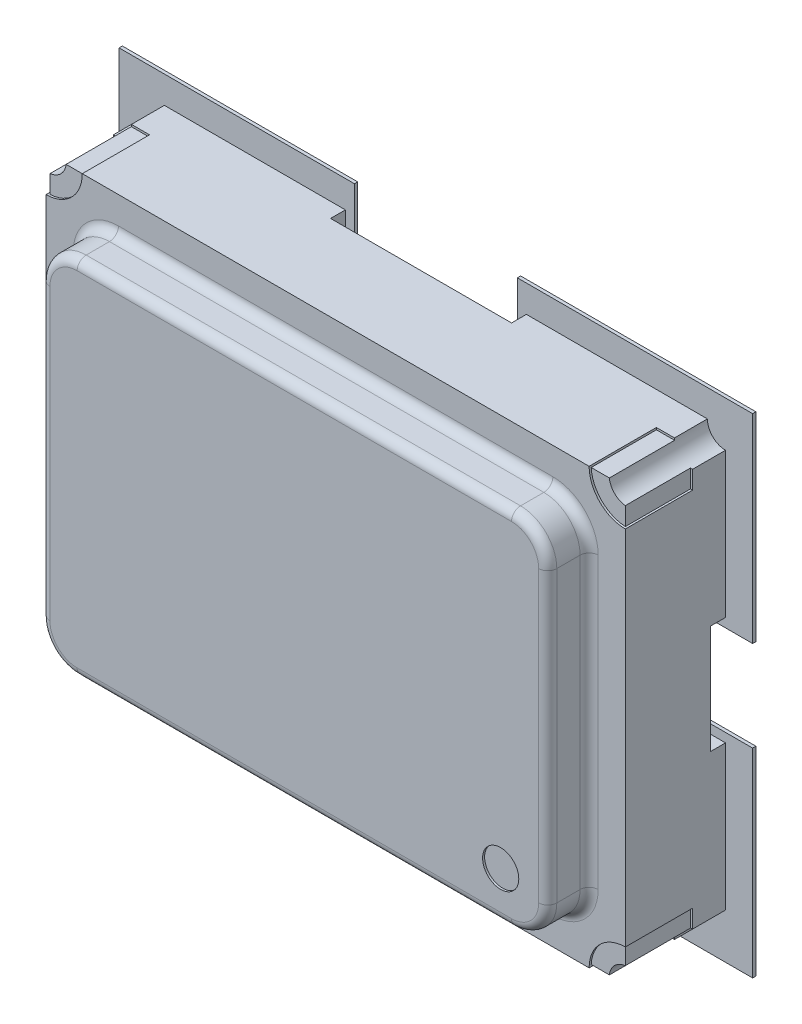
ISO-10303-21;
HEADER;
FILE_DESCRIPTION(('STEP AP214'),'2;1');
FILE_NAME('part.step','',(''),(''),'','','');
FILE_SCHEMA(('AUTOMOTIVE_DESIGN { 1 0 10303 214 1 1 1 1 }'));
ENDSEC;
DATA;
#1=APPLICATION_CONTEXT('core data for automotive mechanical design processes');
#2=APPLICATION_PROTOCOL_DEFINITION('international standard','automotive_design',2000,#1);
#3=PRODUCT_CONTEXT('',#1,'mechanical');
#4=PRODUCT('Part','Part','',(#3));
#5=PRODUCT_RELATED_PRODUCT_CATEGORY('part','',(#4));
#6=PRODUCT_DEFINITION_FORMATION('','',#4);
#7=PRODUCT_DEFINITION_CONTEXT('part definition',#1,'design');
#8=PRODUCT_DEFINITION('design','',#6,#7);
#9=PRODUCT_DEFINITION_SHAPE('','',#8);
#10=(LENGTH_UNIT() NAMED_UNIT(*) SI_UNIT(.MILLI.,.METRE.));
#11=(NAMED_UNIT(*) PLANE_ANGLE_UNIT() SI_UNIT($,.RADIAN.));
#12=(NAMED_UNIT(*) SI_UNIT($,.STERADIAN.) SOLID_ANGLE_UNIT());
#13=UNCERTAINTY_MEASURE_WITH_UNIT(LENGTH_MEASURE(1.E-05),#10,'distance_accuracy_value','');
#14=(GEOMETRIC_REPRESENTATION_CONTEXT(3) GLOBAL_UNCERTAINTY_ASSIGNED_CONTEXT((#13)) GLOBAL_UNIT_ASSIGNED_CONTEXT((#10,
#11,#12)) REPRESENTATION_CONTEXT('',''));
#15=CARTESIAN_POINT('',(0.,0.,0.));
#16=DIRECTION('',(0.,0.,1.));
#17=DIRECTION('',(1.,0.,0.));
#18=AXIS2_PLACEMENT_3D('',#15,#16,#17);
#19=CARTESIAN_POINT('',(0.,0.,0.0762));
#20=DIRECTION('',(0.,0.,1.));
#21=DIRECTION('',(1.,0.,0.));
#22=AXIS2_PLACEMENT_3D('',#19,#20,#21);
#23=PLANE('',#22);
#24=DIRECTION('',(0.,1.,0.));
#25=VECTOR('',#24,1.);
#26=CARTESIAN_POINT('',(-0.875000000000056,0.675000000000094,0.0762));
#27=LINE('',#26,#25);
#28=CARTESIAN_POINT('',(-0.875000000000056,0.675000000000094,0.0762));
#29=VERTEX_POINT('',#28);
#30=CARTESIAN_POINT('',(-0.875000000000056,0.125000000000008,0.0762));
#31=VERTEX_POINT('',#30);
#32=EDGE_CURVE('E723',#29,#31,#27,.F.);
#33=ORIENTED_EDGE('',*,*,#32,.F.);
#34=DIRECTION('',(1.,0.,0.));
#35=VECTOR('',#34,1.);
#36=CARTESIAN_POINT('',(-0.224999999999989,0.675000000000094,0.0762));
#37=LINE('',#36,#35);
#38=CARTESIAN_POINT('',(-0.224999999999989,0.675000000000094,0.0762));
#39=VERTEX_POINT('',#38);
#40=EDGE_CURVE('E728',#39,#29,#37,.F.);
#41=ORIENTED_EDGE('',*,*,#40,.F.);
#42=DIRECTION('',(0.,1.,0.));
#43=VECTOR('',#42,1.);
#44=CARTESIAN_POINT('',(-0.224999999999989,0.125000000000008,0.0762));
#45=LINE('',#44,#43);
#46=CARTESIAN_POINT('',(-0.224999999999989,0.125000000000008,0.0762));
#47=VERTEX_POINT('',#46);
#48=EDGE_CURVE('E701',#47,#39,#45,.T.);
#49=ORIENTED_EDGE('',*,*,#48,.F.);
#50=DIRECTION('',(1.,0.,0.));
#51=VECTOR('',#50,1.);
#52=CARTESIAN_POINT('',(-0.875000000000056,0.125000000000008,0.0762));
#53=LINE('',#52,#51);
#54=EDGE_CURVE('E718',#31,#47,#53,.T.);
#55=ORIENTED_EDGE('',*,*,#54,.F.);
#56=EDGE_LOOP('',(#33,#41,#49,#55));
#57=FACE_BOUND('',#56,.T.);
#58=ADVANCED_FACE('F16',(#57),#23,.F.);
#59=CARTESIAN_POINT('',(0.,0.,0.0762));
#60=DIRECTION('',(0.,0.,1.));
#61=DIRECTION('',(1.,0.,0.));
#62=AXIS2_PLACEMENT_3D('',#59,#60,#61);
#63=PLANE('',#62);
#64=DIRECTION('',(1.,0.,0.));
#65=VECTOR('',#64,1.);
#66=CARTESIAN_POINT('',(-0.875000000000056,-0.675000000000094,0.0762));
#67=LINE('',#66,#65);
#68=CARTESIAN_POINT('',(-0.875000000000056,-0.675000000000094,0.0762));
#69=VERTEX_POINT('',#68);
#70=CARTESIAN_POINT('',(-0.224999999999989,-0.675000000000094,0.0762));
#71=VERTEX_POINT('',#70);
#72=EDGE_CURVE('E694',#69,#71,#67,.T.);
#73=ORIENTED_EDGE('',*,*,#72,.F.);
#74=DIRECTION('',(0.,1.,0.));
#75=VECTOR('',#74,1.);
#76=CARTESIAN_POINT('',(-0.875000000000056,-0.125000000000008,0.0762));
#77=LINE('',#76,#75);
#78=CARTESIAN_POINT('',(-0.875000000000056,-0.125000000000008,0.0762));
#79=VERTEX_POINT('',#78);
#80=EDGE_CURVE('E699',#79,#69,#77,.F.);
#81=ORIENTED_EDGE('',*,*,#80,.F.);
#82=DIRECTION('',(1.,0.,0.));
#83=VECTOR('',#82,1.);
#84=CARTESIAN_POINT('',(-0.224999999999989,-0.125000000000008,0.0762));
#85=LINE('',#84,#83);
#86=CARTESIAN_POINT('',(-0.224999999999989,-0.125000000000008,0.0762));
#87=VERTEX_POINT('',#86);
#88=EDGE_CURVE('E680',#87,#79,#85,.F.);
#89=ORIENTED_EDGE('',*,*,#88,.F.);
#90=DIRECTION('',(0.,1.,0.));
#91=VECTOR('',#90,1.);
#92=CARTESIAN_POINT('',(-0.224999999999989,-0.675000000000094,0.0762));
#93=LINE('',#92,#91);
#94=EDGE_CURVE('E689',#71,#87,#93,.T.);
#95=ORIENTED_EDGE('',*,*,#94,.F.);
#96=EDGE_LOOP('',(#73,#81,#89,#95));
#97=FACE_BOUND('',#96,.T.);
#98=ADVANCED_FACE('F2561',(#97),#63,.F.);
#99=CARTESIAN_POINT('',(0.,0.,0.0762));
#100=DIRECTION('',(0.,0.,1.));
#101=DIRECTION('',(1.,0.,0.));
#102=AXIS2_PLACEMENT_3D('',#99,#100,#101);
#103=PLANE('',#102);
#104=DIRECTION('',(1.,0.,0.));
#105=VECTOR('',#104,1.);
#106=CARTESIAN_POINT('',(0.875000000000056,0.675000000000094,0.0762));
#107=LINE('',#106,#105);
#108=CARTESIAN_POINT('',(0.875000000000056,0.675000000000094,0.0762));
#109=VERTEX_POINT('',#108);
#110=CARTESIAN_POINT('',(0.224999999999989,0.675000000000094,0.0762));
#111=VERTEX_POINT('',#110);
#112=EDGE_CURVE('E673',#109,#111,#107,.F.);
#113=ORIENTED_EDGE('',*,*,#112,.F.);
#114=DIRECTION('',(0.,1.,0.));
#115=VECTOR('',#114,1.);
#116=CARTESIAN_POINT('',(0.875000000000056,0.125000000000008,0.0762));
#117=LINE('',#116,#115);
#118=CARTESIAN_POINT('',(0.875000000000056,0.125000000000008,0.0762));
#119=VERTEX_POINT('',#118);
#120=EDGE_CURVE('E678',#119,#109,#117,.T.);
#121=ORIENTED_EDGE('',*,*,#120,.F.);
#122=DIRECTION('',(1.,0.,0.));
#123=VECTOR('',#122,1.);
#124=CARTESIAN_POINT('',(0.224999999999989,0.125000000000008,0.0762));
#125=LINE('',#124,#123);
#126=CARTESIAN_POINT('',(0.224999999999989,0.125000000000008,0.0762));
#127=VERTEX_POINT('',#126);
#128=EDGE_CURVE('E651',#127,#119,#125,.T.);
#129=ORIENTED_EDGE('',*,*,#128,.F.);
#130=DIRECTION('',(0.,1.,0.));
#131=VECTOR('',#130,1.);
#132=CARTESIAN_POINT('',(0.224999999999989,0.675000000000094,0.0762));
#133=LINE('',#132,#131);
#134=EDGE_CURVE('E668',#111,#127,#133,.F.);
#135=ORIENTED_EDGE('',*,*,#134,.F.);
#136=EDGE_LOOP('',(#113,#121,#129,#135));
#137=FACE_BOUND('',#136,.T.);
#138=ADVANCED_FACE('F2552',(#137),#103,.F.);
#139=CARTESIAN_POINT('',(0.,0.,0.0762));
#140=DIRECTION('',(0.,0.,1.));
#141=DIRECTION('',(1.,0.,0.));
#142=AXIS2_PLACEMENT_3D('',#139,#140,#141);
#143=PLANE('',#142);
#144=DIRECTION('',(0.,1.,0.));
#145=VECTOR('',#144,1.);
#146=CARTESIAN_POINT('',(0.875000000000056,-0.675000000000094,0.0762));
#147=LINE('',#146,#145);
#148=CARTESIAN_POINT('',(0.875000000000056,-0.675000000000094,0.0762));
#149=VERTEX_POINT('',#148);
#150=CARTESIAN_POINT('',(0.875000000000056,-0.125000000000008,0.0762));
#151=VERTEX_POINT('',#150);
#152=EDGE_CURVE('E639',#149,#151,#147,.T.);
#153=ORIENTED_EDGE('',*,*,#152,.F.);
#154=DIRECTION('',(1.,0.,0.));
#155=VECTOR('',#154,1.);
#156=CARTESIAN_POINT('',(0.224999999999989,-0.675000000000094,0.0762));
#157=LINE('',#156,#155);
#158=CARTESIAN_POINT('',(0.224999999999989,-0.675000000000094,0.0762));
#159=VERTEX_POINT('',#158);
#160=EDGE_CURVE('E644',#159,#149,#157,.T.);
#161=ORIENTED_EDGE('',*,*,#160,.F.);
#162=DIRECTION('',(0.,1.,0.));
#163=VECTOR('',#162,1.);
#164=CARTESIAN_POINT('',(0.224999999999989,-0.274999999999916,0.0762));
#165=LINE('',#164,#163);
#166=CARTESIAN_POINT('',(0.225000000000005,-0.274999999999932,0.0762));
#167=VERTEX_POINT('',#166);
#168=EDGE_CURVE('E649',#167,#159,#165,.F.);
#169=ORIENTED_EDGE('',*,*,#168,.F.);
#170=DIRECTION('',(-0.707106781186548,-0.707106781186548,0.));
#171=VECTOR('',#170,1.);
#172=CARTESIAN_POINT('',(0.375000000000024,-0.125000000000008,0.0762));
#173=LINE('',#172,#171);
#174=CARTESIAN_POINT('',(0.375000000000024,-0.125000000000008,0.0762));
#175=VERTEX_POINT('',#174);
#176=EDGE_CURVE('E624',#175,#167,#173,.T.);
#177=ORIENTED_EDGE('',*,*,#176,.F.);
#178=DIRECTION('',(1.,0.,0.));
#179=VECTOR('',#178,1.);
#180=CARTESIAN_POINT('',(0.875000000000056,-0.125000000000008,0.0762));
#181=LINE('',#180,#179);
#182=EDGE_CURVE('E634',#151,#175,#181,.F.);
#183=ORIENTED_EDGE('',*,*,#182,.F.);
#184=EDGE_LOOP('',(#153,#161,#169,#177,#183));
#185=FACE_BOUND('',#184,.T.);
#186=ADVANCED_FACE('F2543',(#185),#143,.F.);
#187=CARTESIAN_POINT('',(-0.224999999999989,0.675000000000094,0.0762));
#188=DIRECTION('',(0.,1.,0.));
#189=DIRECTION('',(0.,0.,1.));
#190=AXIS2_PLACEMENT_3D('',#187,#188,#189);
#191=PLANE('',#190);
#192=DIRECTION('',(0.,0.,-1.));
#193=VECTOR('',#192,1.);
#194=CARTESIAN_POINT('',(-0.224999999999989,0.675000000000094,0.0762));
#195=LINE('',#194,#193);
#196=CARTESIAN_POINT('',(-0.224999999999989,0.675000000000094,0.0851999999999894));
#197=VERTEX_POINT('',#196);
#198=EDGE_CURVE('E715',#39,#197,#195,.F.);
#199=ORIENTED_EDGE('',*,*,#198,.F.);
#200=ORIENTED_EDGE('',*,*,#40,.T.);
#201=DIRECTION('',(0.,0.,1.));
#202=VECTOR('',#201,1.);
#203=CARTESIAN_POINT('',(-0.875000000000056,0.675000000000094,0.0762));
#204=LINE('',#203,#202);
#205=CARTESIAN_POINT('',(-0.875000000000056,0.675000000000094,0.0851999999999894));
#206=VERTEX_POINT('',#205);
#207=EDGE_CURVE('E725',#206,#29,#204,.F.);
#208=ORIENTED_EDGE('',*,*,#207,.F.);
#209=DIRECTION('',(1.,0.,0.));
#210=VECTOR('',#209,1.);
#211=CARTESIAN_POINT('',(0.,0.675000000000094,0.0851999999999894));
#212=LINE('',#211,#210);
#213=EDGE_CURVE('E840',#197,#206,#212,.F.);
#214=ORIENTED_EDGE('',*,*,#213,.F.);
#215=EDGE_LOOP('',(#199,#200,#208,#214));
#216=FACE_BOUND('',#215,.T.);
#217=ADVANCED_FACE('F2534',(#216),#191,.T.);
#218=CARTESIAN_POINT('',(-0.875000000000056,0.675000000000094,0.0762));
#219=DIRECTION('',(-1.,0.,0.));
#220=DIRECTION('',(0.,0.,1.));
#221=AXIS2_PLACEMENT_3D('',#218,#219,#220);
#222=PLANE('',#221);
#223=ORIENTED_EDGE('',*,*,#207,.T.);
#224=ORIENTED_EDGE('',*,*,#32,.T.);
#225=DIRECTION('',(0.,0.,-1.));
#226=VECTOR('',#225,1.);
#227=CARTESIAN_POINT('',(-0.875000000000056,0.125000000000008,0.0762));
#228=LINE('',#227,#226);
#229=CARTESIAN_POINT('',(-0.875000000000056,0.125000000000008,0.0851999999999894));
#230=VERTEX_POINT('',#229);
#231=EDGE_CURVE('E720',#230,#31,#228,.T.);
#232=ORIENTED_EDGE('',*,*,#231,.F.);
#233=DIRECTION('',(0.,1.,0.));
#234=VECTOR('',#233,1.);
#235=CARTESIAN_POINT('',(-0.875000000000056,0.,0.0851999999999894));
#236=LINE('',#235,#234);
#237=EDGE_CURVE('E1123',#206,#230,#236,.F.);
#238=ORIENTED_EDGE('',*,*,#237,.F.);
#239=EDGE_LOOP('',(#223,#224,#232,#238));
#240=FACE_BOUND('',#239,.T.);
#241=ADVANCED_FACE('F2525',(#240),#222,.T.);
#242=CARTESIAN_POINT('',(-0.875000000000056,0.125000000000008,0.0762));
#243=DIRECTION('',(0.,-1.,0.));
#244=DIRECTION('',(0.,0.,-1.));
#245=AXIS2_PLACEMENT_3D('',#242,#243,#244);
#246=PLANE('',#245);
#247=ORIENTED_EDGE('',*,*,#231,.T.);
#248=ORIENTED_EDGE('',*,*,#54,.T.);
#249=DIRECTION('',(0.,0.,-1.));
#250=VECTOR('',#249,1.);
#251=CARTESIAN_POINT('',(-0.224999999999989,0.125000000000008,0.0762));
#252=LINE('',#251,#250);
#253=CARTESIAN_POINT('',(-0.224999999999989,0.125000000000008,0.0851999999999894));
#254=VERTEX_POINT('',#253);
#255=EDGE_CURVE('E712',#254,#47,#252,.T.);
#256=ORIENTED_EDGE('',*,*,#255,.F.);
#257=DIRECTION('',(1.,0.,0.));
#258=VECTOR('',#257,1.);
#259=CARTESIAN_POINT('',(0.,0.125000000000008,0.0851999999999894));
#260=LINE('',#259,#258);
#261=EDGE_CURVE('E1120',#230,#254,#260,.T.);
#262=ORIENTED_EDGE('',*,*,#261,.F.);
#263=EDGE_LOOP('',(#247,#248,#256,#262));
#264=FACE_BOUND('',#263,.T.);
#265=ADVANCED_FACE('F2516',(#264),#246,.T.);
#266=CARTESIAN_POINT('',(-0.224999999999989,0.125000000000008,0.0762));
#267=DIRECTION('',(1.,0.,0.));
#268=DIRECTION('',(0.,0.,-1.));
#269=AXIS2_PLACEMENT_3D('',#266,#267,#268);
#270=PLANE('',#269);
#271=ORIENTED_EDGE('',*,*,#255,.T.);
#272=ORIENTED_EDGE('',*,*,#48,.T.);
#273=ORIENTED_EDGE('',*,*,#198,.T.);
#274=DIRECTION('',(0.,1.,0.));
#275=VECTOR('',#274,1.);
#276=CARTESIAN_POINT('',(-0.224999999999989,0.,0.0851999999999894));
#277=LINE('',#276,#275);
#278=EDGE_CURVE('E538',#254,#197,#277,.T.);
#279=ORIENTED_EDGE('',*,*,#278,.F.);
#280=EDGE_LOOP('',(#271,#272,#273,#279));
#281=FACE_BOUND('',#280,.T.);
#282=ADVANCED_FACE('F2507',(#281),#270,.T.);
#283=CARTESIAN_POINT('',(-0.875000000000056,-0.125000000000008,0.0762));
#284=DIRECTION('',(-1.,0.,0.));
#285=DIRECTION('',(0.,0.,1.));
#286=AXIS2_PLACEMENT_3D('',#283,#284,#285);
#287=PLANE('',#286);
#288=DIRECTION('',(0.,0.,1.));
#289=VECTOR('',#288,1.);
#290=CARTESIAN_POINT('',(-0.875000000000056,-0.125000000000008,0.0762));
#291=LINE('',#290,#289);
#292=CARTESIAN_POINT('',(-0.875000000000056,-0.125000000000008,0.0851999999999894));
#293=VERTEX_POINT('',#292);
#294=EDGE_CURVE('E686',#79,#293,#291,.T.);
#295=ORIENTED_EDGE('',*,*,#294,.F.);
#296=ORIENTED_EDGE('',*,*,#80,.T.);
#297=DIRECTION('',(0.,0.,-1.));
#298=VECTOR('',#297,1.);
#299=CARTESIAN_POINT('',(-0.875000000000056,-0.675000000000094,0.0762));
#300=LINE('',#299,#298);
#301=CARTESIAN_POINT('',(-0.875000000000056,-0.675000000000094,0.0851999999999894));
#302=VERTEX_POINT('',#301);
#303=EDGE_CURVE('E696',#302,#69,#300,.T.);
#304=ORIENTED_EDGE('',*,*,#303,.F.);
#305=DIRECTION('',(0.,1.,0.));
#306=VECTOR('',#305,1.);
#307=CARTESIAN_POINT('',(-0.875000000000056,0.,0.0851999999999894));
#308=LINE('',#307,#306);
#309=EDGE_CURVE('E832',#293,#302,#308,.F.);
#310=ORIENTED_EDGE('',*,*,#309,.F.);
#311=EDGE_LOOP('',(#295,#296,#304,#310));
#312=FACE_BOUND('',#311,.T.);
#313=ADVANCED_FACE('F2498',(#312),#287,.T.);
#314=CARTESIAN_POINT('',(-0.875000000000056,-0.675000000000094,0.0762));
#315=DIRECTION('',(0.,-1.,0.));
#316=DIRECTION('',(0.,0.,-1.));
#317=AXIS2_PLACEMENT_3D('',#314,#315,#316);
#318=PLANE('',#317);
#319=ORIENTED_EDGE('',*,*,#303,.T.);
#320=ORIENTED_EDGE('',*,*,#72,.T.);
#321=DIRECTION('',(0.,0.,-1.));
#322=VECTOR('',#321,1.);
#323=CARTESIAN_POINT('',(-0.224999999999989,-0.675000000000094,0.0762));
#324=LINE('',#323,#322);
#325=CARTESIAN_POINT('',(-0.224999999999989,-0.675000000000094,0.0851999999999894));
#326=VERTEX_POINT('',#325);
#327=EDGE_CURVE('E691',#326,#71,#324,.T.);
#328=ORIENTED_EDGE('',*,*,#327,.F.);
#329=DIRECTION('',(1.,0.,0.));
#330=VECTOR('',#329,1.);
#331=CARTESIAN_POINT('',(0.,-0.675000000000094,0.0851999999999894));
#332=LINE('',#331,#330);
#333=EDGE_CURVE('E1054',#302,#326,#332,.T.);
#334=ORIENTED_EDGE('',*,*,#333,.F.);
#335=EDGE_LOOP('',(#319,#320,#328,#334));
#336=FACE_BOUND('',#335,.T.);
#337=ADVANCED_FACE('F2489',(#336),#318,.T.);
#338=CARTESIAN_POINT('',(-0.224999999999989,-0.675000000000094,0.0762));
#339=DIRECTION('',(1.,0.,0.));
#340=DIRECTION('',(0.,0.,-1.));
#341=AXIS2_PLACEMENT_3D('',#338,#339,#340);
#342=PLANE('',#341);
#343=ORIENTED_EDGE('',*,*,#327,.T.);
#344=ORIENTED_EDGE('',*,*,#94,.T.);
#345=DIRECTION('',(0.,0.,1.));
#346=VECTOR('',#345,1.);
#347=CARTESIAN_POINT('',(-0.224999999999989,-0.125000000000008,0.0762));
#348=LINE('',#347,#346);
#349=CARTESIAN_POINT('',(-0.224999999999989,-0.125000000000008,0.0851999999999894));
#350=VERTEX_POINT('',#349);
#351=EDGE_CURVE('E683',#350,#87,#348,.F.);
#352=ORIENTED_EDGE('',*,*,#351,.F.);
#353=DIRECTION('',(0.,1.,0.));
#354=VECTOR('',#353,1.);
#355=CARTESIAN_POINT('',(-0.224999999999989,0.,0.0851999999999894));
#356=LINE('',#355,#354);
#357=EDGE_CURVE('E1051',#326,#350,#356,.T.);
#358=ORIENTED_EDGE('',*,*,#357,.F.);
#359=EDGE_LOOP('',(#343,#344,#352,#358));
#360=FACE_BOUND('',#359,.T.);
#361=ADVANCED_FACE('F2480',(#360),#342,.T.);
#362=CARTESIAN_POINT('',(-0.224999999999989,-0.125000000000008,0.0762));
#363=DIRECTION('',(0.,1.,0.));
#364=DIRECTION('',(0.,0.,1.));
#365=AXIS2_PLACEMENT_3D('',#362,#363,#364);
#366=PLANE('',#365);
#367=ORIENTED_EDGE('',*,*,#351,.T.);
#368=ORIENTED_EDGE('',*,*,#88,.T.);
#369=ORIENTED_EDGE('',*,*,#294,.T.);
#370=DIRECTION('',(1.,0.,0.));
#371=VECTOR('',#370,1.);
#372=CARTESIAN_POINT('',(0.,-0.125000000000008,0.0851999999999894));
#373=LINE('',#372,#371);
#374=EDGE_CURVE('E923',#350,#293,#373,.F.);
#375=ORIENTED_EDGE('',*,*,#374,.F.);
#376=EDGE_LOOP('',(#367,#368,#369,#375));
#377=FACE_BOUND('',#376,.T.);
#378=ADVANCED_FACE('F2471',(#377),#366,.T.);
#379=CARTESIAN_POINT('',(0.875000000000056,0.125000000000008,0.0762));
#380=DIRECTION('',(1.,0.,0.));
#381=DIRECTION('',(0.,0.,-1.));
#382=AXIS2_PLACEMENT_3D('',#379,#380,#381);
#383=PLANE('',#382);
#384=DIRECTION('',(0.,0.,-1.));
#385=VECTOR('',#384,1.);
#386=CARTESIAN_POINT('',(0.875000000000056,0.125000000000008,0.0762));
#387=LINE('',#386,#385);
#388=CARTESIAN_POINT('',(0.875000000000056,0.125000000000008,0.0851999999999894));
#389=VERTEX_POINT('',#388);
#390=EDGE_CURVE('E665',#119,#389,#387,.F.);
#391=ORIENTED_EDGE('',*,*,#390,.F.);
#392=ORIENTED_EDGE('',*,*,#120,.T.);
#393=DIRECTION('',(0.,0.,1.));
#394=VECTOR('',#393,1.);
#395=CARTESIAN_POINT('',(0.875000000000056,0.675000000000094,0.0762));
#396=LINE('',#395,#394);
#397=CARTESIAN_POINT('',(0.875000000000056,0.675000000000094,0.0851999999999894));
#398=VERTEX_POINT('',#397);
#399=EDGE_CURVE('E675',#398,#109,#396,.F.);
#400=ORIENTED_EDGE('',*,*,#399,.F.);
#401=DIRECTION('',(0.,1.,0.));
#402=VECTOR('',#401,1.);
#403=CARTESIAN_POINT('',(0.875000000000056,0.,0.0851999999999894));
#404=LINE('',#403,#402);
#405=EDGE_CURVE('E1022',#389,#398,#404,.T.);
#406=ORIENTED_EDGE('',*,*,#405,.F.);
#407=EDGE_LOOP('',(#391,#392,#400,#406));
#408=FACE_BOUND('',#407,.T.);
#409=ADVANCED_FACE('F2462',(#408),#383,.T.);
#410=CARTESIAN_POINT('',(0.875000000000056,0.675000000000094,0.0762));
#411=DIRECTION('',(0.,1.,0.));
#412=DIRECTION('',(0.,0.,1.));
#413=AXIS2_PLACEMENT_3D('',#410,#411,#412);
#414=PLANE('',#413);
#415=ORIENTED_EDGE('',*,*,#399,.T.);
#416=ORIENTED_EDGE('',*,*,#112,.T.);
#417=DIRECTION('',(0.,0.,1.));
#418=VECTOR('',#417,1.);
#419=CARTESIAN_POINT('',(0.224999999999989,0.675000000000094,0.0762));
#420=LINE('',#419,#418);
#421=CARTESIAN_POINT('',(0.224999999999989,0.675000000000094,0.0851999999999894));
#422=VERTEX_POINT('',#421);
#423=EDGE_CURVE('E670',#422,#111,#420,.F.);
#424=ORIENTED_EDGE('',*,*,#423,.F.);
#425=DIRECTION('',(1.,0.,0.));
#426=VECTOR('',#425,1.);
#427=CARTESIAN_POINT('',(0.,0.675000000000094,0.0851999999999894));
#428=LINE('',#427,#426);
#429=EDGE_CURVE('E1019',#398,#422,#428,.F.);
#430=ORIENTED_EDGE('',*,*,#429,.F.);
#431=EDGE_LOOP('',(#415,#416,#424,#430));
#432=FACE_BOUND('',#431,.T.);
#433=ADVANCED_FACE('F2453',(#432),#414,.T.);
#434=CARTESIAN_POINT('',(0.224999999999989,0.675000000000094,0.0762));
#435=DIRECTION('',(-1.,0.,0.));
#436=DIRECTION('',(0.,0.,1.));
#437=AXIS2_PLACEMENT_3D('',#434,#435,#436);
#438=PLANE('',#437);
#439=ORIENTED_EDGE('',*,*,#423,.T.);
#440=ORIENTED_EDGE('',*,*,#134,.T.);
#441=DIRECTION('',(0.,0.,-1.));
#442=VECTOR('',#441,1.);
#443=CARTESIAN_POINT('',(0.224999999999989,0.125000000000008,0.0762));
#444=LINE('',#443,#442);
#445=CARTESIAN_POINT('',(0.224999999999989,0.125000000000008,0.0851999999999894));
#446=VERTEX_POINT('',#445);
#447=EDGE_CURVE('E662',#446,#127,#444,.T.);
#448=ORIENTED_EDGE('',*,*,#447,.F.);
#449=DIRECTION('',(0.,1.,0.));
#450=VECTOR('',#449,1.);
#451=CARTESIAN_POINT('',(0.224999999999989,0.,0.0851999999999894));
#452=LINE('',#451,#450);
#453=EDGE_CURVE('E1016',#422,#446,#452,.F.);
#454=ORIENTED_EDGE('',*,*,#453,.F.);
#455=EDGE_LOOP('',(#439,#440,#448,#454));
#456=FACE_BOUND('',#455,.T.);
#457=ADVANCED_FACE('F2444',(#456),#438,.T.);
#458=CARTESIAN_POINT('',(0.224999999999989,0.125000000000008,0.0762));
#459=DIRECTION('',(0.,-1.,0.));
#460=DIRECTION('',(0.,0.,-1.));
#461=AXIS2_PLACEMENT_3D('',#458,#459,#460);
#462=PLANE('',#461);
#463=ORIENTED_EDGE('',*,*,#447,.T.);
#464=ORIENTED_EDGE('',*,*,#128,.T.);
#465=ORIENTED_EDGE('',*,*,#390,.T.);
#466=DIRECTION('',(1.,0.,0.));
#467=VECTOR('',#466,1.);
#468=CARTESIAN_POINT('',(0.,0.125000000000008,0.0851999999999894));
#469=LINE('',#468,#467);
#470=EDGE_CURVE('E869',#446,#389,#469,.T.);
#471=ORIENTED_EDGE('',*,*,#470,.F.);
#472=EDGE_LOOP('',(#463,#464,#465,#471));
#473=FACE_BOUND('',#472,.T.);
#474=ADVANCED_FACE('F2435',(#473),#462,.T.);
#475=CARTESIAN_POINT('',(0.224999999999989,-0.274999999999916,0.0762));
#476=DIRECTION('',(-1.,0.,0.));
#477=DIRECTION('',(0.,0.,1.));
#478=AXIS2_PLACEMENT_3D('',#475,#476,#477);
#479=PLANE('',#478);
#480=DIRECTION('',(0.,0.,1.));
#481=VECTOR('',#480,1.);
#482=CARTESIAN_POINT('',(0.225000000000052,-0.274999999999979,0.0762));
#483=LINE('',#482,#481);
#484=CARTESIAN_POINT('',(0.225000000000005,-0.274999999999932,0.0851999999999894));
#485=VERTEX_POINT('',#484);
#486=EDGE_CURVE('E631',#167,#485,#483,.T.);
#487=ORIENTED_EDGE('',*,*,#486,.F.);
#488=ORIENTED_EDGE('',*,*,#168,.T.);
#489=DIRECTION('',(0.,0.,-1.));
#490=VECTOR('',#489,1.);
#491=CARTESIAN_POINT('',(0.224999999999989,-0.675000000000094,0.0762));
#492=LINE('',#491,#490);
#493=CARTESIAN_POINT('',(0.224999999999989,-0.675000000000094,0.0851999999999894));
#494=VERTEX_POINT('',#493);
#495=EDGE_CURVE('E646',#494,#159,#492,.T.);
#496=ORIENTED_EDGE('',*,*,#495,.F.);
#497=DIRECTION('',(0.,1.,0.));
#498=VECTOR('',#497,1.);
#499=CARTESIAN_POINT('',(0.224999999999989,0.,0.0851999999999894));
#500=LINE('',#499,#498);
#501=EDGE_CURVE('E818',#485,#494,#500,.F.);
#502=ORIENTED_EDGE('',*,*,#501,.F.);
#503=EDGE_LOOP('',(#487,#488,#496,#502));
#504=FACE_BOUND('',#503,.T.);
#505=ADVANCED_FACE('F2426',(#504),#479,.T.);
#506=CARTESIAN_POINT('',(0.224999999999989,-0.675000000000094,0.0762));
#507=DIRECTION('',(0.,-1.,0.));
#508=DIRECTION('',(0.,0.,-1.));
#509=AXIS2_PLACEMENT_3D('',#506,#507,#508);
#510=PLANE('',#509);
#511=ORIENTED_EDGE('',*,*,#495,.T.);
#512=ORIENTED_EDGE('',*,*,#160,.T.);
#513=DIRECTION('',(0.,0.,-1.));
#514=VECTOR('',#513,1.);
#515=CARTESIAN_POINT('',(0.875000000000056,-0.675000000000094,0.0762));
#516=LINE('',#515,#514);
#517=CARTESIAN_POINT('',(0.875000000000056,-0.675000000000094,0.0851999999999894));
#518=VERTEX_POINT('',#517);
#519=EDGE_CURVE('E641',#518,#149,#516,.T.);
#520=ORIENTED_EDGE('',*,*,#519,.F.);
#521=DIRECTION('',(1.,0.,0.));
#522=VECTOR('',#521,1.);
#523=CARTESIAN_POINT('',(0.,-0.675000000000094,0.0851999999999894));
#524=LINE('',#523,#522);
#525=EDGE_CURVE('E983',#494,#518,#524,.T.);
#526=ORIENTED_EDGE('',*,*,#525,.F.);
#527=EDGE_LOOP('',(#511,#512,#520,#526));
#528=FACE_BOUND('',#527,.T.);
#529=ADVANCED_FACE('F2417',(#528),#510,.T.);
#530=CARTESIAN_POINT('',(0.875000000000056,-0.675000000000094,0.0762));
#531=DIRECTION('',(1.,0.,0.));
#532=DIRECTION('',(0.,0.,-1.));
#533=AXIS2_PLACEMENT_3D('',#530,#531,#532);
#534=PLANE('',#533);
#535=ORIENTED_EDGE('',*,*,#519,.T.);
#536=ORIENTED_EDGE('',*,*,#152,.T.);
#537=DIRECTION('',(0.,0.,1.));
#538=VECTOR('',#537,1.);
#539=CARTESIAN_POINT('',(0.875000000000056,-0.125000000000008,0.0762));
#540=LINE('',#539,#538);
#541=CARTESIAN_POINT('',(0.875000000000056,-0.125000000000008,0.0851999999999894));
#542=VERTEX_POINT('',#541);
#543=EDGE_CURVE('E636',#542,#151,#540,.F.);
#544=ORIENTED_EDGE('',*,*,#543,.F.);
#545=DIRECTION('',(0.,1.,0.));
#546=VECTOR('',#545,1.);
#547=CARTESIAN_POINT('',(0.875000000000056,0.,0.0851999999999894));
#548=LINE('',#547,#546);
#549=EDGE_CURVE('E980',#518,#542,#548,.T.);
#550=ORIENTED_EDGE('',*,*,#549,.F.);
#551=EDGE_LOOP('',(#535,#536,#544,#550));
#552=FACE_BOUND('',#551,.T.);
#553=ADVANCED_FACE('F2408',(#552),#534,.T.);
#554=CARTESIAN_POINT('',(0.875000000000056,-0.125000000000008,0.0762));
#555=DIRECTION('',(0.,1.,0.));
#556=DIRECTION('',(0.,0.,1.));
#557=AXIS2_PLACEMENT_3D('',#554,#555,#556);
#558=PLANE('',#557);
#559=ORIENTED_EDGE('',*,*,#543,.T.);
#560=ORIENTED_EDGE('',*,*,#182,.T.);
#561=DIRECTION('',(0.,0.,1.));
#562=VECTOR('',#561,1.);
#563=CARTESIAN_POINT('',(0.375000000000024,-0.125000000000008,0.0762));
#564=LINE('',#563,#562);
#565=CARTESIAN_POINT('',(0.375000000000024,-0.125000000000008,0.0851999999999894));
#566=VERTEX_POINT('',#565);
#567=EDGE_CURVE('E628',#566,#175,#564,.F.);
#568=ORIENTED_EDGE('',*,*,#567,.F.);
#569=DIRECTION('',(1.,0.,0.));
#570=VECTOR('',#569,1.);
#571=CARTESIAN_POINT('',(0.,-0.125000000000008,0.0851999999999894));
#572=LINE('',#571,#570);
#573=EDGE_CURVE('E977',#542,#566,#572,.F.);
#574=ORIENTED_EDGE('',*,*,#573,.F.);
#575=EDGE_LOOP('',(#559,#560,#568,#574));
#576=FACE_BOUND('',#575,.T.);
#577=ADVANCED_FACE('F2399',(#576),#558,.T.);
#578=CARTESIAN_POINT('',(0.375000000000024,-0.125000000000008,0.0762));
#579=DIRECTION('',(-0.707106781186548,0.707106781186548,0.));
#580=DIRECTION('',(-0.707106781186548,-0.707106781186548,0.));
#581=AXIS2_PLACEMENT_3D('',#578,#579,#580);
#582=PLANE('',#581);
#583=ORIENTED_EDGE('',*,*,#567,.T.);
#584=ORIENTED_EDGE('',*,*,#176,.T.);
#585=ORIENTED_EDGE('',*,*,#486,.T.);
#586=DIRECTION('',(-0.707106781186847,-0.707106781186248,0.));
#587=VECTOR('',#586,1.);
#588=CARTESIAN_POINT('',(0.375000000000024,-0.125000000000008,0.0851999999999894));
#589=LINE('',#588,#587);
#590=EDGE_CURVE('E974',#566,#485,#589,.T.);
#591=ORIENTED_EDGE('',*,*,#590,.F.);
#592=EDGE_LOOP('',(#583,#584,#585,#591));
#593=FACE_BOUND('',#592,.T.);
#594=ADVANCED_FACE('F2388',(#593),#582,.T.);
#595=CARTESIAN_POINT('',(0.399999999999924,-0.15000000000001,0.0762));
#596=DIRECTION('',(-0.707106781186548,0.707106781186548,0.));
#597=DIRECTION('',(-0.707106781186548,-0.707106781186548,0.));
#598=AXIS2_PLACEMENT_3D('',#595,#596,#597);
#599=PLANE('',#598);
#600=DIRECTION('',(0.,0.,1.));
#601=VECTOR('',#600,1.);
#602=CARTESIAN_POINT('',(0.399999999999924,-0.15000000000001,0.0762));
#603=LINE('',#602,#601);
#604=CARTESIAN_POINT('',(0.399999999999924,-0.15000000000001,0.0851999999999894));
#605=VERTEX_POINT('',#604);
#606=CARTESIAN_POINT('',(0.399999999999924,-0.15000000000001,0.126200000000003));
#607=VERTEX_POINT('',#606);
#608=EDGE_CURVE('E616',#605,#607,#603,.T.);
#609=ORIENTED_EDGE('',*,*,#608,.F.);
#610=DIRECTION('',(0.707106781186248,0.707106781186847,0.));
#611=VECTOR('',#610,1.);
#612=CARTESIAN_POINT('',(0.249999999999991,-0.30000000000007,0.0851999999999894));
#613=LINE('',#612,#611);
#614=CARTESIAN_POINT('',(0.249999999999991,-0.30000000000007,0.0851999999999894));
#615=VERTEX_POINT('',#614);
#616=EDGE_CURVE('E609',#615,#605,#613,.T.);
#617=ORIENTED_EDGE('',*,*,#616,.F.);
#618=DIRECTION('',(0.,0.,1.));
#619=VECTOR('',#618,1.);
#620=CARTESIAN_POINT('',(0.249999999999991,-0.30000000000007,0.0762));
#621=LINE('',#620,#619);
#622=CARTESIAN_POINT('',(0.249999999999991,-0.30000000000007,0.126200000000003));
#623=VERTEX_POINT('',#622);
#624=EDGE_CURVE('E587',#623,#615,#621,.F.);
#625=ORIENTED_EDGE('',*,*,#624,.F.);
#626=DIRECTION('',(0.707106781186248,0.707106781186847,0.));
#627=VECTOR('',#626,1.);
#628=CARTESIAN_POINT('',(0.249999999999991,-0.30000000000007,0.126200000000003));
#629=LINE('',#628,#627);
#630=EDGE_CURVE('E593',#623,#607,#629,.T.);
#631=ORIENTED_EDGE('',*,*,#630,.T.);
#632=EDGE_LOOP('',(#609,#617,#625,#631));
#633=FACE_BOUND('',#632,.T.);
#634=ADVANCED_FACE('F2379',(#633),#599,.T.);
#635=CARTESIAN_POINT('',(-0.249999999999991,0.15000000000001,0.0762));
#636=DIRECTION('',(1.,0.,0.));
#637=DIRECTION('',(0.,0.,-1.));
#638=AXIS2_PLACEMENT_3D('',#635,#636,#637);
#639=PLANE('',#638);
#640=DIRECTION('',(0.,0.,-1.));
#641=VECTOR('',#640,1.);
#642=CARTESIAN_POINT('',(-0.249999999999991,0.15000000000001,0.0762));
#643=LINE('',#642,#641);
#644=CARTESIAN_POINT('',(-0.249999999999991,0.15000000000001,0.0851999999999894));
#645=VERTEX_POINT('',#644);
#646=CARTESIAN_POINT('',(-0.249999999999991,0.15000000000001,0.126200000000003));
#647=VERTEX_POINT('',#646);
#648=EDGE_CURVE('E603',#645,#647,#643,.F.);
#649=ORIENTED_EDGE('',*,*,#648,.F.);
#650=DIRECTION('',(0.,1.,0.));
#651=VECTOR('',#650,1.);
#652=CARTESIAN_POINT('',(-0.249999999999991,0.,0.0851999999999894));
#653=LINE('',#652,#651);
#654=CARTESIAN_POINT('',(-0.249999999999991,0.599999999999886,0.0851999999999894));
#655=VERTEX_POINT('',#654);
#656=EDGE_CURVE('E534',#655,#645,#653,.F.);
#657=ORIENTED_EDGE('',*,*,#656,.F.);
#658=DIRECTION('',(0.,0.,1.));
#659=VECTOR('',#658,1.);
#660=CARTESIAN_POINT('',(-0.249999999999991,0.599999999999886,0.0762));
#661=LINE('',#660,#659);
#662=CARTESIAN_POINT('',(-0.249999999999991,0.599999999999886,0.126200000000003));
#663=VERTEX_POINT('',#662);
#664=EDGE_CURVE('E526',#663,#655,#661,.F.);
#665=ORIENTED_EDGE('',*,*,#664,.F.);
#666=DIRECTION('',(0.,1.,0.));
#667=VECTOR('',#666,1.);
#668=CARTESIAN_POINT('',(-0.249999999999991,0.,0.126200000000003));
#669=LINE('',#668,#667);
#670=EDGE_CURVE('E550',#663,#647,#669,.F.);
#671=ORIENTED_EDGE('',*,*,#670,.T.);
#672=EDGE_LOOP('',(#649,#657,#665,#671));
#673=FACE_BOUND('',#672,.T.);
#674=ADVANCED_FACE('F886',(#673),#639,.T.);
#675=CARTESIAN_POINT('',(0.249999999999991,0.599999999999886,0.0762));
#676=DIRECTION('',(-1.,0.,0.));
#677=DIRECTION('',(0.,0.,1.));
#678=AXIS2_PLACEMENT_3D('',#675,#676,#677);
#679=PLANE('',#678);
#680=DIRECTION('',(0.,0.,1.));
#681=VECTOR('',#680,1.);
#682=CARTESIAN_POINT('',(0.249999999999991,0.599999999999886,0.0762));
#683=LINE('',#682,#681);
#684=CARTESIAN_POINT('',(0.249999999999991,0.599999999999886,0.0851999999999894));
#685=VERTEX_POINT('',#684);
#686=CARTESIAN_POINT('',(0.249999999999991,0.599999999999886,0.126200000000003));
#687=VERTEX_POINT('',#686);
#688=EDGE_CURVE('E808',#685,#687,#683,.T.);
#689=ORIENTED_EDGE('',*,*,#688,.F.);
#690=DIRECTION('',(0.,1.,0.));
#691=VECTOR('',#690,1.);
#692=CARTESIAN_POINT('',(0.249999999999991,0.,0.0851999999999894));
#693=LINE('',#692,#691);
#694=CARTESIAN_POINT('',(0.249999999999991,0.15000000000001,0.0851999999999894));
#695=VERTEX_POINT('',#694);
#696=EDGE_CURVE('E826',#695,#685,#693,.T.);
#697=ORIENTED_EDGE('',*,*,#696,.F.);
#698=DIRECTION('',(0.,0.,-1.));
#699=VECTOR('',#698,1.);
#700=CARTESIAN_POINT('',(0.249999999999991,0.15000000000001,0.0762));
#701=LINE('',#700,#699);
#702=CARTESIAN_POINT('',(0.249999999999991,0.15000000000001,0.126200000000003));
#703=VERTEX_POINT('',#702);
#704=EDGE_CURVE('E568',#703,#695,#701,.T.);
#705=ORIENTED_EDGE('',*,*,#704,.F.);
#706=DIRECTION('',(0.,1.,0.));
#707=VECTOR('',#706,1.);
#708=CARTESIAN_POINT('',(0.249999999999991,0.,0.126200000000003));
#709=LINE('',#708,#707);
#710=EDGE_CURVE('E553',#703,#687,#709,.T.);
#711=ORIENTED_EDGE('',*,*,#710,.T.);
#712=EDGE_LOOP('',(#689,#697,#705,#711));
#713=FACE_BOUND('',#712,.T.);
#714=ADVANCED_FACE('F876',(#713),#679,.T.);
#715=CARTESIAN_POINT('',(-0.794412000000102,0.50015625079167,0.0762));
#716=DIRECTION('',(1.,0.,0.));
#717=DIRECTION('',(0.,1.,0.));
#718=AXIS2_PLACEMENT_3D('',#715,#716,#717);
#719=PLANE('',#718);
#720=DIRECTION('',(0.,1.,0.));
#721=VECTOR('',#720,1.);
#722=CARTESIAN_POINT('',(-0.794412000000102,0.,0.356362));
#723=LINE('',#722,#721);
#724=CARTESIAN_POINT('',(-0.794412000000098,0.550313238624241,0.356362));
#725=VERTEX_POINT('',#724);
#726=CARTESIAN_POINT('',(-0.794412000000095,0.500156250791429,0.356362));
#727=VERTEX_POINT('',#726);
#728=EDGE_CURVE('E627',#725,#727,#723,.F.);
#729=ORIENTED_EDGE('',*,*,#728,.F.);
#730=DIRECTION('',(0.,0.,1.));
#731=VECTOR('',#730,1.);
#732=CARTESIAN_POINT('',(-0.794412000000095,0.550313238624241,0.0762));
#733=LINE('',#732,#731);
#734=CARTESIAN_POINT('',(-0.794412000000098,0.550313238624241,0.1761999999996));
#735=VERTEX_POINT('',#734);
#736=EDGE_CURVE('E730',#725,#735,#733,.F.);
#737=ORIENTED_EDGE('',*,*,#736,.T.);
#738=DIRECTION('',(0.,1.,0.));
#739=VECTOR('',#738,1.);
#740=CARTESIAN_POINT('',(-0.794412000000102,0.,0.1761999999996));
#741=LINE('',#740,#739);
#742=CARTESIAN_POINT('',(-0.794412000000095,0.500156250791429,0.1761999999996));
#743=VERTEX_POINT('',#742);
#744=EDGE_CURVE('E510',#743,#735,#741,.T.);
#745=ORIENTED_EDGE('',*,*,#744,.F.);
#746=DIRECTION('',(0.,0.,1.));
#747=VECTOR('',#746,1.);
#748=CARTESIAN_POINT('',(-0.794412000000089,0.500156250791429,0.0762));
#749=LINE('',#748,#747);
#750=EDGE_CURVE('E804',#743,#727,#749,.T.);
#751=ORIENTED_EDGE('',*,*,#750,.T.);
#752=EDGE_LOOP('',(#729,#737,#745,#751));
#753=FACE_BOUND('',#752,.T.);
#754=ADVANCED_FACE('F852',(#753),#719,.F.);
#755=CARTESIAN_POINT('',(0.,0.,0.356362));
#756=DIRECTION('',(0.,0.,1.));
#757=DIRECTION('',(1.,0.,0.));
#758=AXIS2_PLACEMENT_3D('',#755,#756,#757);
#759=PLANE('',#758);
#760=DIRECTION('',(1.,0.,0.));
#761=VECTOR('',#760,1.);
#762=CARTESIAN_POINT('',(-0.750313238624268,0.594411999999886,0.356362));
#763=LINE('',#762,#761);
#764=CARTESIAN_POINT('',(-0.700156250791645,0.594411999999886,0.356362));
#765=VERTEX_POINT('',#764);
#766=CARTESIAN_POINT('',(-0.750313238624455,0.594411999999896,0.356362));
#767=VERTEX_POINT('',#766);
#768=EDGE_CURVE('E848',#765,#767,#763,.F.);
#769=ORIENTED_EDGE('',*,*,#768,.T.);
#770=CARTESIAN_POINT('',(-0.800000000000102,0.599999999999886,0.356362));
#771=DIRECTION('',(0.,0.,1.));
#772=DIRECTION('',(1.,0.,0.));
#773=AXIS2_PLACEMENT_3D('',#770,#771,#772);
#774=CIRCLE('',#773,0.0500000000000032);
#775=EDGE_CURVE('E733',#767,#725,#774,.F.);
#776=ORIENTED_EDGE('',*,*,#775,.T.);
#777=ORIENTED_EDGE('',*,*,#728,.T.);
#778=CARTESIAN_POINT('',(-0.800000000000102,0.599999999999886,0.356362));
#779=DIRECTION('',(0.,0.,1.));
#780=DIRECTION('',(1.,0.,0.));
#781=AXIS2_PLACEMENT_3D('',#778,#779,#780);
#782=CIRCLE('',#781,0.100000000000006);
#783=EDGE_CURVE('E802',#727,#765,#782,.T.);
#784=ORIENTED_EDGE('',*,*,#783,.T.);
#785=EDGE_LOOP('',(#769,#776,#777,#784));
#786=FACE_BOUND('',#785,.T.);
#787=ADVANCED_FACE('F845',(#786),#759,.T.);
#788=CARTESIAN_POINT('',(-0.750313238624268,0.594411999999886,0.0762));
#789=DIRECTION('',(0.,-1.,0.));
#790=DIRECTION('',(0.,0.,-1.));
#791=AXIS2_PLACEMENT_3D('',#788,#789,#790);
#792=PLANE('',#791);
#793=ORIENTED_EDGE('',*,*,#768,.F.);
#794=DIRECTION('',(0.,0.,1.));
#795=VECTOR('',#794,1.);
#796=CARTESIAN_POINT('',(-0.700156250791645,0.594411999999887,0.0762));
#797=LINE('',#796,#795);
#798=CARTESIAN_POINT('',(-0.700156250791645,0.594411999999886,0.1761999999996));
#799=VERTEX_POINT('',#798);
#800=EDGE_CURVE('E801',#765,#799,#797,.F.);
#801=ORIENTED_EDGE('',*,*,#800,.T.);
#802=DIRECTION('',(1.,0.,0.));
#803=VECTOR('',#802,1.);
#804=CARTESIAN_POINT('',(0.,0.594411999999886,0.1761999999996));
#805=LINE('',#804,#803);
#806=CARTESIAN_POINT('',(-0.750313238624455,0.594411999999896,0.1761999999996));
#807=VERTEX_POINT('',#806);
#808=EDGE_CURVE('E606',#807,#799,#805,.T.);
#809=ORIENTED_EDGE('',*,*,#808,.F.);
#810=DIRECTION('',(0.,0.,1.));
#811=VECTOR('',#810,1.);
#812=CARTESIAN_POINT('',(-0.750313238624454,0.594411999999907,0.0762));
#813=LINE('',#812,#811);
#814=EDGE_CURVE('E507',#807,#767,#813,.T.);
#815=ORIENTED_EDGE('',*,*,#814,.T.);
#816=EDGE_LOOP('',(#793,#801,#809,#815));
#817=FACE_BOUND('',#816,.T.);
#818=ADVANCED_FACE('F2338',(#817),#792,.F.);
#819=CARTESIAN_POINT('',(0.,0.,0.1761999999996));
#820=DIRECTION('',(0.,0.,1.));
#821=DIRECTION('',(1.,0.,0.));
#822=AXIS2_PLACEMENT_3D('',#819,#820,#821);
#823=PLANE('',#822);
#824=ORIENTED_EDGE('',*,*,#808,.T.);
#825=CARTESIAN_POINT('',(-0.800000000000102,0.599999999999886,0.1761999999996));
#826=DIRECTION('',(0.,0.,1.));
#827=DIRECTION('',(1.,0.,0.));
#828=AXIS2_PLACEMENT_3D('',#825,#826,#827);
#829=CIRCLE('',#828,0.100000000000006);
#830=CARTESIAN_POINT('',(-0.700000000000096,0.599999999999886,0.1761999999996));
#831=VERTEX_POINT('',#830);
#832=EDGE_CURVE('E515',#799,#831,#829,.T.);
#833=ORIENTED_EDGE('',*,*,#832,.T.);
#834=DIRECTION('',(1.,0.,0.));
#835=VECTOR('',#834,1.);
#836=CARTESIAN_POINT('',(0.750000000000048,0.599999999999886,0.1761999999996));
#837=LINE('',#836,#835);
#838=CARTESIAN_POINT('',(-0.750000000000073,0.599999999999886,0.1761999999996));
#839=VERTEX_POINT('',#838);
#840=EDGE_CURVE('E512',#839,#831,#837,.T.);
#841=ORIENTED_EDGE('',*,*,#840,.F.);
#842=CARTESIAN_POINT('',(-0.800000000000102,0.599999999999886,0.1761999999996));
#843=DIRECTION('',(0.,0.,1.));
#844=DIRECTION('',(1.,0.,0.));
#845=AXIS2_PLACEMENT_3D('',#842,#843,#844);
#846=CIRCLE('',#845,0.0500000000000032);
#847=EDGE_CURVE('E19',#839,#807,#846,.F.);
#848=ORIENTED_EDGE('',*,*,#847,.T.);
#849=EDGE_LOOP('',(#824,#833,#841,#848));
#850=FACE_BOUND('',#849,.T.);
#851=ADVANCED_FACE('F513',(#850),#823,.T.);
#852=CARTESIAN_POINT('',(-0.800000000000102,0.15000000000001,0.0762));
#853=DIRECTION('',(0.,-1.,0.));
#854=DIRECTION('',(0.,0.,-1.));
#855=AXIS2_PLACEMENT_3D('',#852,#853,#854);
#856=PLANE('',#855);
#857=DIRECTION('',(0.,0.,1.));
#858=VECTOR('',#857,1.);
#859=CARTESIAN_POINT('',(-0.800000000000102,0.15000000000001,0.0762));
#860=LINE('',#859,#858);
#861=CARTESIAN_POINT('',(-0.800000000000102,0.15000000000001,0.0851999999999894));
#862=VERTEX_POINT('',#861);
#863=CARTESIAN_POINT('',(-0.800000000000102,0.15000000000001,0.126200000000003));
#864=VERTEX_POINT('',#863);
#865=EDGE_CURVE('E933',#862,#864,#860,.T.);
#866=ORIENTED_EDGE('',*,*,#865,.F.);
#867=DIRECTION('',(1.,0.,0.));
#868=VECTOR('',#867,1.);
#869=CARTESIAN_POINT('',(0.,0.15000000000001,0.0851999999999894));
#870=LINE('',#869,#868);
#871=EDGE_CURVE('E537',#645,#862,#870,.F.);
#872=ORIENTED_EDGE('',*,*,#871,.F.);
#873=ORIENTED_EDGE('',*,*,#648,.T.);
#874=DIRECTION('',(1.,0.,0.));
#875=VECTOR('',#874,1.);
#876=CARTESIAN_POINT('',(0.,0.15000000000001,0.126200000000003));
#877=LINE('',#876,#875);
#878=EDGE_CURVE('E552',#647,#864,#877,.F.);
#879=ORIENTED_EDGE('',*,*,#878,.T.);
#880=EDGE_LOOP('',(#866,#872,#873,#879));
#881=FACE_BOUND('',#880,.T.);
#882=ADVANCED_FACE('F1134',(#881),#856,.T.);
#883=CARTESIAN_POINT('',(-0.249999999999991,-0.15000000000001,0.0762));
#884=DIRECTION('',(0.,1.,0.));
#885=DIRECTION('',(0.,0.,1.));
#886=AXIS2_PLACEMENT_3D('',#883,#884,#885);
#887=PLANE('',#886);
#888=DIRECTION('',(0.,0.,-1.));
#889=VECTOR('',#888,1.);
#890=CARTESIAN_POINT('',(-0.249999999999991,-0.15000000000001,0.0762));
#891=LINE('',#890,#889);
#892=CARTESIAN_POINT('',(-0.249999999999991,-0.15000000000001,0.0851999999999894));
#893=VERTEX_POINT('',#892);
#894=CARTESIAN_POINT('',(-0.249999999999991,-0.15000000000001,0.126200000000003));
#895=VERTEX_POINT('',#894);
#896=EDGE_CURVE('E590',#893,#895,#891,.F.);
#897=ORIENTED_EDGE('',*,*,#896,.F.);
#898=DIRECTION('',(1.,0.,0.));
#899=VECTOR('',#898,1.);
#900=CARTESIAN_POINT('',(0.,-0.15000000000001,0.0851999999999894));
#901=LINE('',#900,#899);
#902=CARTESIAN_POINT('',(-0.800000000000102,-0.15000000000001,0.0851999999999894));
#903=VERTEX_POINT('',#902);
#904=EDGE_CURVE('E920',#903,#893,#901,.T.);
#905=ORIENTED_EDGE('',*,*,#904,.F.);
#906=DIRECTION('',(0.,0.,1.));
#907=VECTOR('',#906,1.);
#908=CARTESIAN_POINT('',(-0.800000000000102,-0.15000000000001,0.0762));
#909=LINE('',#908,#907);
#910=CARTESIAN_POINT('',(-0.800000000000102,-0.15000000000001,0.126200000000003));
#911=VERTEX_POINT('',#910);
#912=EDGE_CURVE('E917',#911,#903,#909,.F.);
#913=ORIENTED_EDGE('',*,*,#912,.F.);
#914=DIRECTION('',(1.,0.,0.));
#915=VECTOR('',#914,1.);
#916=CARTESIAN_POINT('',(0.,-0.15000000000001,0.126200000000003));
#917=LINE('',#916,#915);
#918=EDGE_CURVE('E936',#911,#895,#917,.T.);
#919=ORIENTED_EDGE('',*,*,#918,.T.);
#920=EDGE_LOOP('',(#897,#905,#913,#919));
#921=FACE_BOUND('',#920,.T.);
#922=ADVANCED_FACE('F1139',(#921),#887,.T.);
#923=CARTESIAN_POINT('',(0.,0.,0.1761999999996));
#924=DIRECTION('',(0.,0.,1.));
#925=DIRECTION('',(1.,0.,0.));
#926=AXIS2_PLACEMENT_3D('',#923,#924,#925);
#927=PLANE('',#926);
#928=DIRECTION('',(0.,1.,0.));
#929=VECTOR('',#928,1.);
#930=CARTESIAN_POINT('',(-0.800000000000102,0.550000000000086,0.1761999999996));
#931=LINE('',#930,#929);
#932=CARTESIAN_POINT('',(-0.800000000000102,0.499999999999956,0.1761999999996));
#933=VERTEX_POINT('',#932);
#934=CARTESIAN_POINT('',(-0.800000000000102,0.549999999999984,0.1761999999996));
#935=VERTEX_POINT('',#934);
#936=EDGE_CURVE('E898',#933,#935,#931,.T.);
#937=ORIENTED_EDGE('',*,*,#936,.F.);
#938=CARTESIAN_POINT('',(-0.800000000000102,0.599999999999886,0.1761999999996));
#939=DIRECTION('',(0.,0.,1.));
#940=DIRECTION('',(1.,0.,0.));
#941=AXIS2_PLACEMENT_3D('',#938,#939,#940);
#942=CIRCLE('',#941,0.100000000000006);
#943=EDGE_CURVE('E805',#933,#743,#942,.T.);
#944=ORIENTED_EDGE('',*,*,#943,.T.);
#945=ORIENTED_EDGE('',*,*,#744,.T.);
#946=CARTESIAN_POINT('',(-0.800000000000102,0.599999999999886,0.1761999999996));
#947=DIRECTION('',(0.,0.,1.));
#948=DIRECTION('',(1.,0.,0.));
#949=AXIS2_PLACEMENT_3D('',#946,#947,#948);
#950=CIRCLE('',#949,0.0500000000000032);
#951=EDGE_CURVE('E732',#735,#935,#950,.F.);
#952=ORIENTED_EDGE('',*,*,#951,.T.);
#953=EDGE_LOOP('',(#937,#944,#945,#952));
#954=FACE_BOUND('',#953,.T.);
#955=ADVANCED_FACE('F855',(#954),#927,.T.);
#956=CARTESIAN_POINT('',(-0.800000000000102,0.599999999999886,0.0762));
#957=DIRECTION('',(0.,0.,1.));
#958=DIRECTION('',(1.,0.,0.));
#959=AXIS2_PLACEMENT_3D('',#956,#957,#958);
#960=CYLINDRICAL_SURFACE('',#959,0.0500000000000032);
#961=ORIENTED_EDGE('',*,*,#951,.F.);
#962=ORIENTED_EDGE('',*,*,#736,.F.);
#963=ORIENTED_EDGE('',*,*,#775,.F.);
#964=ORIENTED_EDGE('',*,*,#814,.F.);
#965=ORIENTED_EDGE('',*,*,#847,.F.);
#966=DIRECTION('',(0.,0.,1.));
#967=VECTOR('',#966,1.);
#968=CARTESIAN_POINT('',(-0.750000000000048,0.599999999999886,0.0762));
#969=LINE('',#968,#967);
#970=CARTESIAN_POINT('',(-0.750000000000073,0.599999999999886,0.0851999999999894));
#971=VERTEX_POINT('',#970);
#972=EDGE_CURVE('E503',#971,#839,#969,.T.);
#973=ORIENTED_EDGE('',*,*,#972,.F.);
#974=CARTESIAN_POINT('',(-0.800000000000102,0.599999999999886,0.0851999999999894));
#975=DIRECTION('',(0.,0.,1.));
#976=DIRECTION('',(1.,0.,0.));
#977=AXIS2_PLACEMENT_3D('',#974,#975,#976);
#978=CIRCLE('',#977,0.0500000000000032);
#979=CARTESIAN_POINT('',(-0.800000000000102,0.549999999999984,0.0851999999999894));
#980=VERTEX_POINT('',#979);
#981=EDGE_CURVE('E837',#980,#971,#978,.T.);
#982=ORIENTED_EDGE('',*,*,#981,.F.);
#983=DIRECTION('',(0.,0.,1.));
#984=VECTOR('',#983,1.);
#985=CARTESIAN_POINT('',(-0.800000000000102,0.550000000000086,0.0762));
#986=LINE('',#985,#984);
#987=EDGE_CURVE('E895',#935,#980,#986,.F.);
#988=ORIENTED_EDGE('',*,*,#987,.F.);
#989=EDGE_LOOP('',(#961,#962,#963,#964,#965,#973,#982,#988));
#990=FACE_BOUND('',#989,.T.);
#991=ADVANCED_FACE('F501',(#990),#960,.F.);
#992=CARTESIAN_POINT('',(0.,0.,0.0851999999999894));
#993=DIRECTION('',(0.,0.,1.));
#994=DIRECTION('',(1.,0.,0.));
#995=AXIS2_PLACEMENT_3D('',#992,#993,#994);
#996=PLANE('',#995);
#997=DIRECTION('',(0.,1.,0.));
#998=VECTOR('',#997,1.);
#999=CARTESIAN_POINT('',(-0.800000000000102,0.550000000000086,0.0851999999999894));
#1000=LINE('',#999,#998);
#1001=EDGE_CURVE('E798',#980,#862,#1000,.F.);
#1002=ORIENTED_EDGE('',*,*,#1001,.F.);
#1003=ORIENTED_EDGE('',*,*,#981,.T.);
#1004=DIRECTION('',(1.,0.,0.));
#1005=VECTOR('',#1004,1.);
#1006=CARTESIAN_POINT('',(0.750000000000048,0.599999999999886,0.0851999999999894));
#1007=LINE('',#1006,#1005);
#1008=EDGE_CURVE('E524',#655,#971,#1007,.F.);
#1009=ORIENTED_EDGE('',*,*,#1008,.F.);
#1010=ORIENTED_EDGE('',*,*,#656,.T.);
#1011=ORIENTED_EDGE('',*,*,#871,.T.);
#1012=EDGE_LOOP('',(#1002,#1003,#1009,#1010,#1011));
#1013=FACE_BOUND('',#1012,.T.);
#1014=ORIENTED_EDGE('',*,*,#261,.T.);
#1015=ORIENTED_EDGE('',*,*,#278,.T.);
#1016=ORIENTED_EDGE('',*,*,#213,.T.);
#1017=ORIENTED_EDGE('',*,*,#237,.T.);
#1018=EDGE_LOOP('',(#1014,#1015,#1016,#1017));
#1019=FACE_BOUND('',#1018,.T.);
#1020=ADVANCED_FACE('F891',(#1013,#1019),#996,.T.);
#1021=CARTESIAN_POINT('',(-0.700156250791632,-0.594411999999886,0.0762));
#1022=DIRECTION('',(0.,1.,0.));
#1023=DIRECTION('',(0.,0.,1.));
#1024=AXIS2_PLACEMENT_3D('',#1021,#1022,#1023);
#1025=PLANE('',#1024);
#1026=DIRECTION('',(1.,0.,0.));
#1027=VECTOR('',#1026,1.);
#1028=CARTESIAN_POINT('',(0.,-0.594411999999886,0.356362));
#1029=LINE('',#1028,#1027);
#1030=CARTESIAN_POINT('',(-0.750313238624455,-0.594411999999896,0.356362));
#1031=VERTEX_POINT('',#1030);
#1032=CARTESIAN_POINT('',(-0.700156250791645,-0.594411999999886,0.356362));
#1033=VERTEX_POINT('',#1032);
#1034=EDGE_CURVE('E839',#1031,#1033,#1029,.T.);
#1035=ORIENTED_EDGE('',*,*,#1034,.F.);
#1036=DIRECTION('',(0.,0.,1.));
#1037=VECTOR('',#1036,1.);
#1038=CARTESIAN_POINT('',(-0.750313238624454,-0.594411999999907,0.0762));
#1039=LINE('',#1038,#1037);
#1040=CARTESIAN_POINT('',(-0.750313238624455,-0.594411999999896,0.1761999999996));
#1041=VERTEX_POINT('',#1040);
#1042=EDGE_CURVE('E702',#1031,#1041,#1039,.F.);
#1043=ORIENTED_EDGE('',*,*,#1042,.T.);
#1044=DIRECTION('',(1.,0.,0.));
#1045=VECTOR('',#1044,1.);
#1046=CARTESIAN_POINT('',(0.,-0.594411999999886,0.1761999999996));
#1047=LINE('',#1046,#1045);
#1048=CARTESIAN_POINT('',(-0.700156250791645,-0.594411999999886,0.1761999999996));
#1049=VERTEX_POINT('',#1048);
#1050=EDGE_CURVE('E589',#1049,#1041,#1047,.F.);
#1051=ORIENTED_EDGE('',*,*,#1050,.F.);
#1052=DIRECTION('',(0.,0.,1.));
#1053=VECTOR('',#1052,1.);
#1054=CARTESIAN_POINT('',(-0.700156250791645,-0.594411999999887,0.0762));
#1055=LINE('',#1054,#1053);
#1056=EDGE_CURVE('E794',#1049,#1033,#1055,.T.);
#1057=ORIENTED_EDGE('',*,*,#1056,.T.);
#1058=EDGE_LOOP('',(#1035,#1043,#1051,#1057));
#1059=FACE_BOUND('',#1058,.T.);
#1060=ADVANCED_FACE('F2280',(#1059),#1025,.F.);
#1061=CARTESIAN_POINT('',(0.,0.,0.356362));
#1062=DIRECTION('',(0.,0.,1.));
#1063=DIRECTION('',(1.,0.,0.));
#1064=AXIS2_PLACEMENT_3D('',#1061,#1062,#1063);
#1065=PLANE('',#1064);
#1066=DIRECTION('',(0.,1.,0.));
#1067=VECTOR('',#1066,1.);
#1068=CARTESIAN_POINT('',(-0.794412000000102,-0.550313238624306,0.356362));
#1069=LINE('',#1068,#1067);
#1070=CARTESIAN_POINT('',(-0.794412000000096,-0.500156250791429,0.356362));
#1071=VERTEX_POINT('',#1070);
#1072=CARTESIAN_POINT('',(-0.794412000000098,-0.550313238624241,0.356362));
#1073=VERTEX_POINT('',#1072);
#1074=EDGE_CURVE('E1111',#1071,#1073,#1069,.F.);
#1075=ORIENTED_EDGE('',*,*,#1074,.T.);
#1076=CARTESIAN_POINT('',(-0.800000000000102,-0.599999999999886,0.356362));
#1077=DIRECTION('',(0.,0.,1.));
#1078=DIRECTION('',(1.,0.,0.));
#1079=AXIS2_PLACEMENT_3D('',#1076,#1077,#1078);
#1080=CIRCLE('',#1079,0.0500000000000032);
#1081=EDGE_CURVE('E705',#1073,#1031,#1080,.F.);
#1082=ORIENTED_EDGE('',*,*,#1081,.T.);
#1083=ORIENTED_EDGE('',*,*,#1034,.T.);
#1084=CARTESIAN_POINT('',(-0.800000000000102,-0.599999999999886,0.356362));
#1085=DIRECTION('',(0.,0.,1.));
#1086=DIRECTION('',(1.,0.,0.));
#1087=AXIS2_PLACEMENT_3D('',#1084,#1085,#1086);
#1088=CIRCLE('',#1087,0.100000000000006);
#1089=EDGE_CURVE('E792',#1033,#1071,#1088,.T.);
#1090=ORIENTED_EDGE('',*,*,#1089,.T.);
#1091=EDGE_LOOP('',(#1075,#1082,#1083,#1090));
#1092=FACE_BOUND('',#1091,.T.);
#1093=ADVANCED_FACE('F2270',(#1092),#1065,.T.);
#1094=CARTESIAN_POINT('',(-0.794412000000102,-0.550313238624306,0.0762));
#1095=DIRECTION('',(1.,0.,0.));
#1096=DIRECTION('',(0.,1.,0.));
#1097=AXIS2_PLACEMENT_3D('',#1094,#1095,#1096);
#1098=PLANE('',#1097);
#1099=ORIENTED_EDGE('',*,*,#1074,.F.);
#1100=DIRECTION('',(0.,0.,1.));
#1101=VECTOR('',#1100,1.);
#1102=CARTESIAN_POINT('',(-0.794412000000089,-0.500156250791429,0.0762));
#1103=LINE('',#1102,#1101);
#1104=CARTESIAN_POINT('',(-0.794412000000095,-0.500156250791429,0.1761999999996));
#1105=VERTEX_POINT('',#1104);
#1106=EDGE_CURVE('E791',#1071,#1105,#1103,.F.);
#1107=ORIENTED_EDGE('',*,*,#1106,.T.);
#1108=DIRECTION('',(0.,1.,0.));
#1109=VECTOR('',#1108,1.);
#1110=CARTESIAN_POINT('',(-0.794412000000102,0.,0.1761999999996));
#1111=LINE('',#1110,#1109);
#1112=CARTESIAN_POINT('',(-0.794412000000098,-0.550313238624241,0.1761999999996));
#1113=VERTEX_POINT('',#1112);
#1114=EDGE_CURVE('E600',#1113,#1105,#1111,.T.);
#1115=ORIENTED_EDGE('',*,*,#1114,.F.);
#1116=DIRECTION('',(0.,0.,1.));
#1117=VECTOR('',#1116,1.);
#1118=CARTESIAN_POINT('',(-0.794412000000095,-0.550313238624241,0.0762));
#1119=LINE('',#1118,#1117);
#1120=EDGE_CURVE('E706',#1113,#1073,#1119,.T.);
#1121=ORIENTED_EDGE('',*,*,#1120,.T.);
#1122=EDGE_LOOP('',(#1099,#1107,#1115,#1121));
#1123=FACE_BOUND('',#1122,.T.);
#1124=ADVANCED_FACE('F2261',(#1123),#1098,.F.);
#1125=CARTESIAN_POINT('',(0.,0.,0.1761999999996));
#1126=DIRECTION('',(0.,0.,1.));
#1127=DIRECTION('',(1.,0.,0.));
#1128=AXIS2_PLACEMENT_3D('',#1125,#1126,#1127);
#1129=PLANE('',#1128);
#1130=ORIENTED_EDGE('',*,*,#1114,.T.);
#1131=CARTESIAN_POINT('',(-0.800000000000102,-0.599999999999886,0.1761999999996));
#1132=DIRECTION('',(0.,0.,1.));
#1133=DIRECTION('',(1.,0.,0.));
#1134=AXIS2_PLACEMENT_3D('',#1131,#1132,#1133);
#1135=CIRCLE('',#1134,0.100000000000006);
#1136=CARTESIAN_POINT('',(-0.800000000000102,-0.499999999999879,0.1761999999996));
#1137=VERTEX_POINT('',#1136);
#1138=EDGE_CURVE('E788',#1105,#1137,#1135,.T.);
#1139=ORIENTED_EDGE('',*,*,#1138,.T.);
#1140=DIRECTION('',(0.,1.,0.));
#1141=VECTOR('',#1140,1.);
#1142=CARTESIAN_POINT('',(-0.800000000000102,0.550000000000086,0.1761999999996));
#1143=LINE('',#1142,#1141);
#1144=CARTESIAN_POINT('',(-0.800000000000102,-0.549999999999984,0.1761999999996));
#1145=VERTEX_POINT('',#1144);
#1146=EDGE_CURVE('E905',#1145,#1137,#1143,.T.);
#1147=ORIENTED_EDGE('',*,*,#1146,.F.);
#1148=CARTESIAN_POINT('',(-0.800000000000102,-0.599999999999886,0.1761999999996));
#1149=DIRECTION('',(0.,0.,1.));
#1150=DIRECTION('',(1.,0.,0.));
#1151=AXIS2_PLACEMENT_3D('',#1148,#1149,#1150);
#1152=CIRCLE('',#1151,0.0500000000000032);
#1153=EDGE_CURVE('E709',#1145,#1113,#1152,.F.);
#1154=ORIENTED_EDGE('',*,*,#1153,.T.);
#1155=EDGE_LOOP('',(#1130,#1139,#1147,#1154));
#1156=FACE_BOUND('',#1155,.T.);
#1157=ADVANCED_FACE('F1154',(#1156),#1129,.T.);
#1158=CARTESIAN_POINT('',(-0.249999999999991,-0.599999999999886,0.0762));
#1159=DIRECTION('',(1.,0.,0.));
#1160=DIRECTION('',(0.,0.,-1.));
#1161=AXIS2_PLACEMENT_3D('',#1158,#1159,#1160);
#1162=PLANE('',#1161);
#1163=DIRECTION('',(0.,0.,-1.));
#1164=VECTOR('',#1163,1.);
#1165=CARTESIAN_POINT('',(-0.249999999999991,-0.599999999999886,0.0762));
#1166=LINE('',#1165,#1164);
#1167=CARTESIAN_POINT('',(-0.249999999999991,-0.599999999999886,0.0851999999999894));
#1168=VERTEX_POINT('',#1167);
#1169=CARTESIAN_POINT('',(-0.249999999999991,-0.599999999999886,0.126200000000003));
#1170=VERTEX_POINT('',#1169);
#1171=EDGE_CURVE('E1071',#1168,#1170,#1166,.F.);
#1172=ORIENTED_EDGE('',*,*,#1171,.F.);
#1173=DIRECTION('',(0.,1.,0.));
#1174=VECTOR('',#1173,1.);
#1175=CARTESIAN_POINT('',(-0.249999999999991,0.,0.0851999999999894));
#1176=LINE('',#1175,#1174);
#1177=EDGE_CURVE('E830',#893,#1168,#1176,.F.);
#1178=ORIENTED_EDGE('',*,*,#1177,.F.);
#1179=ORIENTED_EDGE('',*,*,#896,.T.);
#1180=DIRECTION('',(0.,1.,0.));
#1181=VECTOR('',#1180,1.);
#1182=CARTESIAN_POINT('',(-0.249999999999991,0.,0.126200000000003));
#1183=LINE('',#1182,#1181);
#1184=EDGE_CURVE('E938',#895,#1170,#1183,.F.);
#1185=ORIENTED_EDGE('',*,*,#1184,.T.);
#1186=EDGE_LOOP('',(#1172,#1178,#1179,#1185));
#1187=FACE_BOUND('',#1186,.T.);
#1188=ADVANCED_FACE('F2242',(#1187),#1162,.T.);
#1189=CARTESIAN_POINT('',(0.249999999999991,-0.30000000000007,0.0762));
#1190=DIRECTION('',(-1.,0.,0.));
#1191=DIRECTION('',(0.,0.,1.));
#1192=AXIS2_PLACEMENT_3D('',#1189,#1190,#1191);
#1193=PLANE('',#1192);
#1194=ORIENTED_EDGE('',*,*,#624,.T.);
#1195=DIRECTION('',(0.,1.,0.));
#1196=VECTOR('',#1195,1.);
#1197=CARTESIAN_POINT('',(0.249999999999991,0.,0.0851999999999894));
#1198=LINE('',#1197,#1196);
#1199=CARTESIAN_POINT('',(0.249999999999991,-0.599999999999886,0.0851999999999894));
#1200=VERTEX_POINT('',#1199);
#1201=EDGE_CURVE('E613',#1200,#615,#1198,.T.);
#1202=ORIENTED_EDGE('',*,*,#1201,.F.);
#1203=DIRECTION('',(0.,0.,-1.));
#1204=VECTOR('',#1203,1.);
#1205=CARTESIAN_POINT('',(0.249999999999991,-0.599999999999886,0.0762));
#1206=LINE('',#1205,#1204);
#1207=CARTESIAN_POINT('',(0.249999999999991,-0.599999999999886,0.126200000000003));
#1208=VERTEX_POINT('',#1207);
#1209=EDGE_CURVE('E1084',#1208,#1200,#1206,.T.);
#1210=ORIENTED_EDGE('',*,*,#1209,.F.);
#1211=DIRECTION('',(0.,1.,0.));
#1212=VECTOR('',#1211,1.);
#1213=CARTESIAN_POINT('',(0.249999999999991,0.,0.126200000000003));
#1214=LINE('',#1213,#1212);
#1215=EDGE_CURVE('E595',#1208,#623,#1214,.T.);
#1216=ORIENTED_EDGE('',*,*,#1215,.T.);
#1217=EDGE_LOOP('',(#1194,#1202,#1210,#1216));
#1218=FACE_BOUND('',#1217,.T.);
#1219=ADVANCED_FACE('F2232',(#1218),#1193,.T.);
#1220=CARTESIAN_POINT('',(0.,0.,0.1761999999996));
#1221=DIRECTION('',(0.,0.,1.));
#1222=DIRECTION('',(1.,0.,0.));
#1223=AXIS2_PLACEMENT_3D('',#1220,#1221,#1222);
#1224=PLANE('',#1223);
#1225=DIRECTION('',(1.,0.,0.));
#1226=VECTOR('',#1225,1.);
#1227=CARTESIAN_POINT('',(-0.750000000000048,-0.599999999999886,0.1761999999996));
#1228=LINE('',#1227,#1226);
#1229=CARTESIAN_POINT('',(-0.700000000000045,-0.599999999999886,0.1761999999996));
#1230=VERTEX_POINT('',#1229);
#1231=CARTESIAN_POINT('',(-0.750000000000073,-0.599999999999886,0.1761999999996));
#1232=VERTEX_POINT('',#1231);
#1233=EDGE_CURVE('E1062',#1230,#1232,#1228,.F.);
#1234=ORIENTED_EDGE('',*,*,#1233,.F.);
#1235=CARTESIAN_POINT('',(-0.800000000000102,-0.599999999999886,0.1761999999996));
#1236=DIRECTION('',(0.,0.,1.));
#1237=DIRECTION('',(1.,0.,0.));
#1238=AXIS2_PLACEMENT_3D('',#1235,#1236,#1237);
#1239=CIRCLE('',#1238,0.100000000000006);
#1240=EDGE_CURVE('E795',#1230,#1049,#1239,.T.);
#1241=ORIENTED_EDGE('',*,*,#1240,.T.);
#1242=ORIENTED_EDGE('',*,*,#1050,.T.);
#1243=CARTESIAN_POINT('',(-0.800000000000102,-0.599999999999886,0.1761999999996));
#1244=DIRECTION('',(0.,0.,1.));
#1245=DIRECTION('',(1.,0.,0.));
#1246=AXIS2_PLACEMENT_3D('',#1243,#1244,#1245);
#1247=CIRCLE('',#1246,0.0500000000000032);
#1248=EDGE_CURVE('E704',#1041,#1232,#1247,.F.);
#1249=ORIENTED_EDGE('',*,*,#1248,.T.);
#1250=EDGE_LOOP('',(#1234,#1241,#1242,#1249));
#1251=FACE_BOUND('',#1250,.T.);
#1252=ADVANCED_FACE('F2224',(#1251),#1224,.T.);
#1253=CARTESIAN_POINT('',(-0.800000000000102,-0.599999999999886,0.0762));
#1254=DIRECTION('',(0.,0.,1.));
#1255=DIRECTION('',(1.,0.,0.));
#1256=AXIS2_PLACEMENT_3D('',#1253,#1254,#1255);
#1257=CYLINDRICAL_SURFACE('',#1256,0.0500000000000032);
#1258=ORIENTED_EDGE('',*,*,#1248,.F.);
#1259=ORIENTED_EDGE('',*,*,#1042,.F.);
#1260=ORIENTED_EDGE('',*,*,#1081,.F.);
#1261=ORIENTED_EDGE('',*,*,#1120,.F.);
#1262=ORIENTED_EDGE('',*,*,#1153,.F.);
#1263=DIRECTION('',(0.,0.,1.));
#1264=VECTOR('',#1263,1.);
#1265=CARTESIAN_POINT('',(-0.800000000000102,-0.550000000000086,0.0762));
#1266=LINE('',#1265,#1264);
#1267=CARTESIAN_POINT('',(-0.800000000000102,-0.549999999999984,0.0851999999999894));
#1268=VERTEX_POINT('',#1267);
#1269=EDGE_CURVE('E911',#1268,#1145,#1266,.T.);
#1270=ORIENTED_EDGE('',*,*,#1269,.F.);
#1271=CARTESIAN_POINT('',(-0.800000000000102,-0.599999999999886,0.0851999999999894));
#1272=DIRECTION('',(0.,0.,1.));
#1273=DIRECTION('',(1.,0.,0.));
#1274=AXIS2_PLACEMENT_3D('',#1271,#1272,#1273);
#1275=CIRCLE('',#1274,0.0500000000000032);
#1276=CARTESIAN_POINT('',(-0.750000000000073,-0.599999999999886,0.0851999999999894));
#1277=VERTEX_POINT('',#1276);
#1278=EDGE_CURVE('E827',#1277,#1268,#1275,.T.);
#1279=ORIENTED_EDGE('',*,*,#1278,.F.);
#1280=DIRECTION('',(0.,0.,-1.));
#1281=VECTOR('',#1280,1.);
#1282=CARTESIAN_POINT('',(-0.750000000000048,-0.599999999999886,0.0762));
#1283=LINE('',#1282,#1281);
#1284=EDGE_CURVE('E1059',#1232,#1277,#1283,.T.);
#1285=ORIENTED_EDGE('',*,*,#1284,.F.);
#1286=EDGE_LOOP('',(#1258,#1259,#1260,#1261,#1262,#1270,#1279,#1285));
#1287=FACE_BOUND('',#1286,.T.);
#1288=ADVANCED_FACE('F1149',(#1287),#1257,.F.);
#1289=CARTESIAN_POINT('',(0.,0.,0.0851999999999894));
#1290=DIRECTION('',(0.,0.,1.));
#1291=DIRECTION('',(1.,0.,0.));
#1292=AXIS2_PLACEMENT_3D('',#1289,#1290,#1291);
#1293=PLANE('',#1292);
#1294=ORIENTED_EDGE('',*,*,#1278,.T.);
#1295=DIRECTION('',(0.,1.,0.));
#1296=VECTOR('',#1295,1.);
#1297=CARTESIAN_POINT('',(-0.800000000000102,0.550000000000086,0.0851999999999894));
#1298=LINE('',#1297,#1296);
#1299=EDGE_CURVE('E914',#903,#1268,#1298,.F.);
#1300=ORIENTED_EDGE('',*,*,#1299,.F.);
#1301=ORIENTED_EDGE('',*,*,#904,.T.);
#1302=ORIENTED_EDGE('',*,*,#1177,.T.);
#1303=DIRECTION('',(1.,0.,0.));
#1304=VECTOR('',#1303,1.);
#1305=CARTESIAN_POINT('',(-0.750000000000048,-0.599999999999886,0.0851999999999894));
#1306=LINE('',#1305,#1304);
#1307=EDGE_CURVE('E787',#1277,#1168,#1306,.T.);
#1308=ORIENTED_EDGE('',*,*,#1307,.F.);
#1309=EDGE_LOOP('',(#1294,#1300,#1301,#1302,#1308));
#1310=FACE_BOUND('',#1309,.T.);
#1311=ORIENTED_EDGE('',*,*,#357,.T.);
#1312=ORIENTED_EDGE('',*,*,#374,.T.);
#1313=ORIENTED_EDGE('',*,*,#309,.T.);
#1314=ORIENTED_EDGE('',*,*,#333,.T.);
#1315=EDGE_LOOP('',(#1311,#1312,#1313,#1314));
#1316=FACE_BOUND('',#1315,.T.);
#1317=ADVANCED_FACE('F1143',(#1310,#1316),#1293,.T.);
#1318=CARTESIAN_POINT('',(0.794412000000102,-0.50015625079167,0.0762));
#1319=DIRECTION('',(-1.,0.,0.));
#1320=DIRECTION('',(0.,0.,1.));
#1321=AXIS2_PLACEMENT_3D('',#1318,#1319,#1320);
#1322=PLANE('',#1321);
#1323=DIRECTION('',(0.,1.,0.));
#1324=VECTOR('',#1323,1.);
#1325=CARTESIAN_POINT('',(0.794412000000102,0.,0.356362));
#1326=LINE('',#1325,#1324);
#1327=CARTESIAN_POINT('',(0.794412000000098,-0.550313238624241,0.356362));
#1328=VERTEX_POINT('',#1327);
#1329=CARTESIAN_POINT('',(0.794412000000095,-0.500156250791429,0.356362));
#1330=VERTEX_POINT('',#1329);
#1331=EDGE_CURVE('E829',#1328,#1330,#1326,.T.);
#1332=ORIENTED_EDGE('',*,*,#1331,.F.);
#1333=DIRECTION('',(0.,0.,1.));
#1334=VECTOR('',#1333,1.);
#1335=CARTESIAN_POINT('',(0.794412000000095,-0.550313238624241,0.0762));
#1336=LINE('',#1335,#1334);
#1337=CARTESIAN_POINT('',(0.794412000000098,-0.550313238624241,0.1761999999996));
#1338=VERTEX_POINT('',#1337);
#1339=EDGE_CURVE('E652',#1328,#1338,#1336,.F.);
#1340=ORIENTED_EDGE('',*,*,#1339,.T.);
#1341=DIRECTION('',(0.,1.,0.));
#1342=VECTOR('',#1341,1.);
#1343=CARTESIAN_POINT('',(0.794412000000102,0.,0.1761999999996));
#1344=LINE('',#1343,#1342);
#1345=CARTESIAN_POINT('',(0.794412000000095,-0.500156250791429,0.1761999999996));
#1346=VERTEX_POINT('',#1345);
#1347=EDGE_CURVE('E823',#1346,#1338,#1344,.F.);
#1348=ORIENTED_EDGE('',*,*,#1347,.F.);
#1349=DIRECTION('',(0.,0.,1.));
#1350=VECTOR('',#1349,1.);
#1351=CARTESIAN_POINT('',(0.794412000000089,-0.500156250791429,0.0762));
#1352=LINE('',#1351,#1350);
#1353=EDGE_CURVE('E783',#1346,#1330,#1352,.T.);
#1354=ORIENTED_EDGE('',*,*,#1353,.T.);
#1355=EDGE_LOOP('',(#1332,#1340,#1348,#1354));
#1356=FACE_BOUND('',#1355,.T.);
#1357=ADVANCED_FACE('F2197',(#1356),#1322,.F.);
#1358=CARTESIAN_POINT('',(0.,0.,0.356362));
#1359=DIRECTION('',(0.,0.,1.));
#1360=DIRECTION('',(1.,0.,0.));
#1361=AXIS2_PLACEMENT_3D('',#1358,#1359,#1360);
#1362=PLANE('',#1361);
#1363=DIRECTION('',(1.,0.,0.));
#1364=VECTOR('',#1363,1.);
#1365=CARTESIAN_POINT('',(0.750313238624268,-0.594411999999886,0.356362));
#1366=LINE('',#1365,#1364);
#1367=CARTESIAN_POINT('',(0.700156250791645,-0.594411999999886,0.356362));
#1368=VERTEX_POINT('',#1367);
#1369=CARTESIAN_POINT('',(0.750313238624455,-0.594411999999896,0.356362));
#1370=VERTEX_POINT('',#1369);
#1371=EDGE_CURVE('E1042',#1368,#1370,#1366,.T.);
#1372=ORIENTED_EDGE('',*,*,#1371,.T.);
#1373=CARTESIAN_POINT('',(0.800000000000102,-0.599999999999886,0.356362));
#1374=DIRECTION('',(0.,0.,1.));
#1375=DIRECTION('',(1.,0.,0.));
#1376=AXIS2_PLACEMENT_3D('',#1373,#1374,#1375);
#1377=CIRCLE('',#1376,0.0500000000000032);
#1378=EDGE_CURVE('E655',#1370,#1328,#1377,.F.);
#1379=ORIENTED_EDGE('',*,*,#1378,.T.);
#1380=ORIENTED_EDGE('',*,*,#1331,.T.);
#1381=CARTESIAN_POINT('',(0.800000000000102,-0.599999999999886,0.356362));
#1382=DIRECTION('',(0.,0.,1.));
#1383=DIRECTION('',(1.,0.,0.));
#1384=AXIS2_PLACEMENT_3D('',#1381,#1382,#1383);
#1385=CIRCLE('',#1384,0.100000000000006);
#1386=EDGE_CURVE('E781',#1330,#1368,#1385,.T.);
#1387=ORIENTED_EDGE('',*,*,#1386,.T.);
#1388=EDGE_LOOP('',(#1372,#1379,#1380,#1387));
#1389=FACE_BOUND('',#1388,.T.);
#1390=ADVANCED_FACE('F2187',(#1389),#1362,.T.);
#1391=CARTESIAN_POINT('',(0.750313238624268,-0.594411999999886,0.0762));
#1392=DIRECTION('',(0.,1.,0.));
#1393=DIRECTION('',(0.,0.,1.));
#1394=AXIS2_PLACEMENT_3D('',#1391,#1392,#1393);
#1395=PLANE('',#1394);
#1396=ORIENTED_EDGE('',*,*,#1371,.F.);
#1397=DIRECTION('',(0.,0.,1.));
#1398=VECTOR('',#1397,1.);
#1399=CARTESIAN_POINT('',(0.700156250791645,-0.594411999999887,0.0762));
#1400=LINE('',#1399,#1398);
#1401=CARTESIAN_POINT('',(0.700156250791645,-0.594411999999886,0.1761999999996));
#1402=VERTEX_POINT('',#1401);
#1403=EDGE_CURVE('E780',#1368,#1402,#1400,.F.);
#1404=ORIENTED_EDGE('',*,*,#1403,.T.);
#1405=DIRECTION('',(1.,0.,0.));
#1406=VECTOR('',#1405,1.);
#1407=CARTESIAN_POINT('',(0.,-0.594411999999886,0.1761999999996));
#1408=LINE('',#1407,#1406);
#1409=CARTESIAN_POINT('',(0.750313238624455,-0.594411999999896,0.1761999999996));
#1410=VERTEX_POINT('',#1409);
#1411=EDGE_CURVE('E1025',#1410,#1402,#1408,.F.);
#1412=ORIENTED_EDGE('',*,*,#1411,.F.);
#1413=DIRECTION('',(0.,0.,1.));
#1414=VECTOR('',#1413,1.);
#1415=CARTESIAN_POINT('',(0.750313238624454,-0.594411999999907,0.0762));
#1416=LINE('',#1415,#1414);
#1417=EDGE_CURVE('E656',#1410,#1370,#1416,.T.);
#1418=ORIENTED_EDGE('',*,*,#1417,.T.);
#1419=EDGE_LOOP('',(#1396,#1404,#1412,#1418));
#1420=FACE_BOUND('',#1419,.T.);
#1421=ADVANCED_FACE('F2178',(#1420),#1395,.F.);
#1422=CARTESIAN_POINT('',(0.,0.,0.1761999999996));
#1423=DIRECTION('',(0.,0.,1.));
#1424=DIRECTION('',(1.,0.,0.));
#1425=AXIS2_PLACEMENT_3D('',#1422,#1423,#1424);
#1426=PLANE('',#1425);
#1427=ORIENTED_EDGE('',*,*,#1411,.T.);
#1428=CARTESIAN_POINT('',(0.800000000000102,-0.599999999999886,0.1761999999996));
#1429=DIRECTION('',(0.,0.,1.));
#1430=DIRECTION('',(1.,0.,0.));
#1431=AXIS2_PLACEMENT_3D('',#1428,#1429,#1430);
#1432=CIRCLE('',#1431,0.100000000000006);
#1433=CARTESIAN_POINT('',(0.700000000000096,-0.599999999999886,0.1761999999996));
#1434=VERTEX_POINT('',#1433);
#1435=EDGE_CURVE('E777',#1402,#1434,#1432,.T.);
#1436=ORIENTED_EDGE('',*,*,#1435,.T.);
#1437=DIRECTION('',(1.,0.,0.));
#1438=VECTOR('',#1437,1.);
#1439=CARTESIAN_POINT('',(-0.750000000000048,-0.599999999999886,0.1761999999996));
#1440=LINE('',#1439,#1438);
#1441=CARTESIAN_POINT('',(0.750000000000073,-0.599999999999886,0.1761999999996));
#1442=VERTEX_POINT('',#1441);
#1443=EDGE_CURVE('E1034',#1442,#1434,#1440,.F.);
#1444=ORIENTED_EDGE('',*,*,#1443,.F.);
#1445=CARTESIAN_POINT('',(0.800000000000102,-0.599999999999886,0.1761999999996));
#1446=DIRECTION('',(0.,0.,1.));
#1447=DIRECTION('',(1.,0.,0.));
#1448=AXIS2_PLACEMENT_3D('',#1445,#1446,#1447);
#1449=CIRCLE('',#1448,0.0500000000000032);
#1450=EDGE_CURVE('E659',#1442,#1410,#1449,.F.);
#1451=ORIENTED_EDGE('',*,*,#1450,.T.);
#1452=EDGE_LOOP('',(#1427,#1436,#1444,#1451));
#1453=FACE_BOUND('',#1452,.T.);
#1454=ADVANCED_FACE('F2170',(#1453),#1426,.T.);
#1455=CARTESIAN_POINT('',(0.,0.,0.0851999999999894));
#1456=DIRECTION('',(0.,0.,1.));
#1457=DIRECTION('',(1.,0.,0.));
#1458=AXIS2_PLACEMENT_3D('',#1455,#1456,#1457);
#1459=PLANE('',#1458);
#1460=DIRECTION('',(1.,0.,0.));
#1461=VECTOR('',#1460,1.);
#1462=CARTESIAN_POINT('',(0.750000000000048,0.599999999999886,0.0851999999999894));
#1463=LINE('',#1462,#1461);
#1464=CARTESIAN_POINT('',(0.750000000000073,0.599999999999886,0.0851999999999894));
#1465=VERTEX_POINT('',#1464);
#1466=EDGE_CURVE('E864',#1465,#685,#1463,.F.);
#1467=ORIENTED_EDGE('',*,*,#1466,.F.);
#1468=CARTESIAN_POINT('',(0.800000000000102,0.599999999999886,0.0851999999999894));
#1469=DIRECTION('',(0.,0.,1.));
#1470=DIRECTION('',(1.,0.,0.));
#1471=AXIS2_PLACEMENT_3D('',#1468,#1469,#1470);
#1472=CIRCLE('',#1471,0.0500000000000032);
#1473=CARTESIAN_POINT('',(0.800000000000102,0.549999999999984,0.0851999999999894));
#1474=VERTEX_POINT('',#1473);
#1475=EDGE_CURVE('E824',#1465,#1474,#1472,.T.);
#1476=ORIENTED_EDGE('',*,*,#1475,.T.);
#1477=DIRECTION('',(0.,1.,0.));
#1478=VECTOR('',#1477,1.);
#1479=CARTESIAN_POINT('',(0.800000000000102,-0.550000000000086,0.0851999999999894));
#1480=LINE('',#1479,#1478);
#1481=CARTESIAN_POINT('',(0.800000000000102,0.15000000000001,0.0851999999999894));
#1482=VERTEX_POINT('',#1481);
#1483=EDGE_CURVE('E1009',#1482,#1474,#1480,.T.);
#1484=ORIENTED_EDGE('',*,*,#1483,.F.);
#1485=DIRECTION('',(1.,0.,0.));
#1486=VECTOR('',#1485,1.);
#1487=CARTESIAN_POINT('',(0.249999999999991,0.15000000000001,0.0851999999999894));
#1488=LINE('',#1487,#1486);
#1489=EDGE_CURVE('E571',#695,#1482,#1488,.T.);
#1490=ORIENTED_EDGE('',*,*,#1489,.F.);
#1491=ORIENTED_EDGE('',*,*,#696,.T.);
#1492=EDGE_LOOP('',(#1467,#1476,#1484,#1490,#1491));
#1493=FACE_BOUND('',#1492,.T.);
#1494=ORIENTED_EDGE('',*,*,#453,.T.);
#1495=ORIENTED_EDGE('',*,*,#470,.T.);
#1496=ORIENTED_EDGE('',*,*,#405,.T.);
#1497=ORIENTED_EDGE('',*,*,#429,.T.);
#1498=EDGE_LOOP('',(#1494,#1495,#1496,#1497));
#1499=FACE_BOUND('',#1498,.T.);
#1500=ADVANCED_FACE('F1478',(#1493,#1499),#1459,.T.);
#1501=CARTESIAN_POINT('',(0.800000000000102,0.599999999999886,0.0762));
#1502=DIRECTION('',(0.,0.,1.));
#1503=DIRECTION('',(1.,0.,0.));
#1504=AXIS2_PLACEMENT_3D('',#1501,#1502,#1503);
#1505=CYLINDRICAL_SURFACE('',#1504,0.0500000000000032);
#1506=CARTESIAN_POINT('',(0.800000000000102,0.599999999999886,0.1761999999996));
#1507=DIRECTION('',(0.,0.,1.));
#1508=DIRECTION('',(1.,0.,0.));
#1509=AXIS2_PLACEMENT_3D('',#1506,#1507,#1508);
#1510=CIRCLE('',#1509,0.0500000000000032);
#1511=CARTESIAN_POINT('',(0.750313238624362,0.594411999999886,0.1761999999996));
#1512=VERTEX_POINT('',#1511);
#1513=CARTESIAN_POINT('',(0.750000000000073,0.599999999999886,0.1761999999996));
#1514=VERTEX_POINT('',#1513);
#1515=EDGE_CURVE('E814',#1512,#1514,#1510,.F.);
#1516=ORIENTED_EDGE('',*,*,#1515,.F.);
#1517=DIRECTION('',(0.,0.,-1.));
#1518=VECTOR('',#1517,1.);
#1519=CARTESIAN_POINT('',(0.750313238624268,0.594411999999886,0.0762));
#1520=LINE('',#1519,#1518);
#1521=CARTESIAN_POINT('',(0.750313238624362,0.594411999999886,0.356362));
#1522=VERTEX_POINT('',#1521);
#1523=EDGE_CURVE('E564',#1512,#1522,#1520,.F.);
#1524=ORIENTED_EDGE('',*,*,#1523,.T.);
#1525=CARTESIAN_POINT('',(0.800000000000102,0.599999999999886,0.356362));
#1526=DIRECTION('',(0.,0.,1.));
#1527=DIRECTION('',(1.,0.,0.));
#1528=AXIS2_PLACEMENT_3D('',#1525,#1526,#1527);
#1529=CIRCLE('',#1528,0.0500000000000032);
#1530=CARTESIAN_POINT('',(0.794412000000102,0.550313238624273,0.356362));
#1531=VERTEX_POINT('',#1530);
#1532=EDGE_CURVE('E811',#1531,#1522,#1529,.F.);
#1533=ORIENTED_EDGE('',*,*,#1532,.F.);
#1534=DIRECTION('',(0.,0.,1.));
#1535=VECTOR('',#1534,1.);
#1536=CARTESIAN_POINT('',(0.794412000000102,0.550313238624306,0.0762));
#1537=LINE('',#1536,#1535);
#1538=CARTESIAN_POINT('',(0.794412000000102,0.550313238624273,0.1761999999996));
#1539=VERTEX_POINT('',#1538);
#1540=EDGE_CURVE('E560',#1531,#1539,#1537,.F.);
#1541=ORIENTED_EDGE('',*,*,#1540,.T.);
#1542=CARTESIAN_POINT('',(0.800000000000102,0.599999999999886,0.1761999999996));
#1543=DIRECTION('',(0.,0.,1.));
#1544=DIRECTION('',(1.,0.,0.));
#1545=AXIS2_PLACEMENT_3D('',#1542,#1543,#1544);
#1546=CIRCLE('',#1545,0.0500000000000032);
#1547=CARTESIAN_POINT('',(0.800000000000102,0.549999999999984,0.1761999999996));
#1548=VERTEX_POINT('',#1547);
#1549=EDGE_CURVE('E562',#1548,#1539,#1546,.F.);
#1550=ORIENTED_EDGE('',*,*,#1549,.F.);
#1551=DIRECTION('',(0.,0.,-1.));
#1552=VECTOR('',#1551,1.);
#1553=CARTESIAN_POINT('',(0.800000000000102,0.550000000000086,0.0762));
#1554=LINE('',#1553,#1552);
#1555=EDGE_CURVE('E963',#1474,#1548,#1554,.F.);
#1556=ORIENTED_EDGE('',*,*,#1555,.F.);
#1557=ORIENTED_EDGE('',*,*,#1475,.F.);
#1558=DIRECTION('',(0.,0.,1.));
#1559=VECTOR('',#1558,1.);
#1560=CARTESIAN_POINT('',(0.750000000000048,0.599999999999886,0.0762));
#1561=LINE('',#1560,#1559);
#1562=EDGE_CURVE('E861',#1514,#1465,#1561,.F.);
#1563=ORIENTED_EDGE('',*,*,#1562,.F.);
#1564=EDGE_LOOP('',(#1516,#1524,#1533,#1541,#1550,#1556,#1557,#1563));
#1565=FACE_BOUND('',#1564,.T.);
#1566=ADVANCED_FACE('F1482',(#1565),#1505,.F.);
#1567=CARTESIAN_POINT('',(0.,0.,0.1761999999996));
#1568=DIRECTION('',(0.,0.,1.));
#1569=DIRECTION('',(1.,0.,0.));
#1570=AXIS2_PLACEMENT_3D('',#1567,#1568,#1569);
#1571=PLANE('',#1570);
#1572=DIRECTION('',(0.,1.,0.));
#1573=VECTOR('',#1572,1.);
#1574=CARTESIAN_POINT('',(0.800000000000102,-0.550000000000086,0.1761999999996));
#1575=LINE('',#1574,#1573);
#1576=CARTESIAN_POINT('',(0.800000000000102,-0.499999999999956,0.1761999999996));
#1577=VERTEX_POINT('',#1576);
#1578=CARTESIAN_POINT('',(0.800000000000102,-0.549999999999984,0.1761999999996));
#1579=VERTEX_POINT('',#1578);
#1580=EDGE_CURVE('E992',#1577,#1579,#1575,.F.);
#1581=ORIENTED_EDGE('',*,*,#1580,.F.);
#1582=CARTESIAN_POINT('',(0.800000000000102,-0.599999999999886,0.1761999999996));
#1583=DIRECTION('',(0.,0.,1.));
#1584=DIRECTION('',(1.,0.,0.));
#1585=AXIS2_PLACEMENT_3D('',#1582,#1583,#1584);
#1586=CIRCLE('',#1585,0.100000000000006);
#1587=EDGE_CURVE('E784',#1577,#1346,#1586,.T.);
#1588=ORIENTED_EDGE('',*,*,#1587,.T.);
#1589=ORIENTED_EDGE('',*,*,#1347,.T.);
#1590=CARTESIAN_POINT('',(0.800000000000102,-0.599999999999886,0.1761999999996));
#1591=DIRECTION('',(0.,0.,1.));
#1592=DIRECTION('',(1.,0.,0.));
#1593=AXIS2_PLACEMENT_3D('',#1590,#1591,#1592);
#1594=CIRCLE('',#1593,0.0500000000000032);
#1595=EDGE_CURVE('E654',#1338,#1579,#1594,.F.);
#1596=ORIENTED_EDGE('',*,*,#1595,.T.);
#1597=EDGE_LOOP('',(#1581,#1588,#1589,#1596));
#1598=FACE_BOUND('',#1597,.T.);
#1599=ADVANCED_FACE('F1456',(#1598),#1571,.T.);
#1600=CARTESIAN_POINT('',(0.800000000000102,-0.599999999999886,0.0762));
#1601=DIRECTION('',(0.,0.,1.));
#1602=DIRECTION('',(1.,0.,0.));
#1603=AXIS2_PLACEMENT_3D('',#1600,#1601,#1602);
#1604=CYLINDRICAL_SURFACE('',#1603,0.0500000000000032);
#1605=ORIENTED_EDGE('',*,*,#1595,.F.);
#1606=ORIENTED_EDGE('',*,*,#1339,.F.);
#1607=ORIENTED_EDGE('',*,*,#1378,.F.);
#1608=ORIENTED_EDGE('',*,*,#1417,.F.);
#1609=ORIENTED_EDGE('',*,*,#1450,.F.);
#1610=DIRECTION('',(0.,0.,-1.));
#1611=VECTOR('',#1610,1.);
#1612=CARTESIAN_POINT('',(0.750000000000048,-0.599999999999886,0.0762));
#1613=LINE('',#1612,#1611);
#1614=CARTESIAN_POINT('',(0.750000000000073,-0.599999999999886,0.0851999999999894));
#1615=VERTEX_POINT('',#1614);
#1616=EDGE_CURVE('E1038',#1615,#1442,#1613,.F.);
#1617=ORIENTED_EDGE('',*,*,#1616,.F.);
#1618=CARTESIAN_POINT('',(0.800000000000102,-0.599999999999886,0.0851999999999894));
#1619=DIRECTION('',(0.,0.,1.));
#1620=DIRECTION('',(1.,0.,0.));
#1621=AXIS2_PLACEMENT_3D('',#1618,#1619,#1620);
#1622=CIRCLE('',#1621,0.0500000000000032);
#1623=CARTESIAN_POINT('',(0.800000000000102,-0.549999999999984,0.0851999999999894));
#1624=VERTEX_POINT('',#1623);
#1625=EDGE_CURVE('E612',#1624,#1615,#1622,.T.);
#1626=ORIENTED_EDGE('',*,*,#1625,.F.);
#1627=DIRECTION('',(0.,0.,-1.));
#1628=VECTOR('',#1627,1.);
#1629=CARTESIAN_POINT('',(0.800000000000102,-0.550000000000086,0.0762));
#1630=LINE('',#1629,#1628);
#1631=EDGE_CURVE('E988',#1579,#1624,#1630,.T.);
#1632=ORIENTED_EDGE('',*,*,#1631,.F.);
#1633=EDGE_LOOP('',(#1605,#1606,#1607,#1608,#1609,#1617,#1626,#1632));
#1634=FACE_BOUND('',#1633,.T.);
#1635=ADVANCED_FACE('F1461',(#1634),#1604,.F.);
#1636=CARTESIAN_POINT('',(0.,0.,0.0851999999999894));
#1637=DIRECTION('',(0.,0.,1.));
#1638=DIRECTION('',(1.,0.,0.));
#1639=AXIS2_PLACEMENT_3D('',#1636,#1637,#1638);
#1640=PLANE('',#1639);
#1641=ORIENTED_EDGE('',*,*,#1625,.T.);
#1642=DIRECTION('',(1.,0.,0.));
#1643=VECTOR('',#1642,1.);
#1644=CARTESIAN_POINT('',(-0.750000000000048,-0.599999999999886,0.0851999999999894));
#1645=LINE('',#1644,#1643);
#1646=EDGE_CURVE('E1081',#1200,#1615,#1645,.T.);
#1647=ORIENTED_EDGE('',*,*,#1646,.F.);
#1648=ORIENTED_EDGE('',*,*,#1201,.T.);
#1649=ORIENTED_EDGE('',*,*,#616,.T.);
#1650=DIRECTION('',(1.,0.,0.));
#1651=VECTOR('',#1650,1.);
#1652=CARTESIAN_POINT('',(0.800000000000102,-0.15000000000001,0.0851999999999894));
#1653=LINE('',#1652,#1651);
#1654=CARTESIAN_POINT('',(0.800000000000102,-0.15000000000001,0.0851999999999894));
#1655=VERTEX_POINT('',#1654);
#1656=EDGE_CURVE('E557',#1655,#605,#1653,.F.);
#1657=ORIENTED_EDGE('',*,*,#1656,.F.);
#1658=DIRECTION('',(0.,1.,0.));
#1659=VECTOR('',#1658,1.);
#1660=CARTESIAN_POINT('',(0.800000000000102,-0.550000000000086,0.0851999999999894));
#1661=LINE('',#1660,#1659);
#1662=EDGE_CURVE('E991',#1624,#1655,#1661,.T.);
#1663=ORIENTED_EDGE('',*,*,#1662,.F.);
#1664=EDGE_LOOP('',(#1641,#1647,#1648,#1649,#1657,#1663));
#1665=FACE_BOUND('',#1664,.T.);
#1666=ORIENTED_EDGE('',*,*,#573,.T.);
#1667=ORIENTED_EDGE('',*,*,#590,.T.);
#1668=ORIENTED_EDGE('',*,*,#501,.T.);
#1669=ORIENTED_EDGE('',*,*,#525,.T.);
#1670=ORIENTED_EDGE('',*,*,#549,.T.);
#1671=EDGE_LOOP('',(#1666,#1667,#1668,#1669,#1670));
#1672=FACE_BOUND('',#1671,.T.);
#1673=ADVANCED_FACE('F1466',(#1665,#1672),#1640,.T.);
#1674=CARTESIAN_POINT('',(0.800000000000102,-0.15000000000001,0.0762));
#1675=DIRECTION('',(0.,1.,0.));
#1676=DIRECTION('',(0.,0.,1.));
#1677=AXIS2_PLACEMENT_3D('',#1674,#1675,#1676);
#1678=PLANE('',#1677);
#1679=DIRECTION('',(0.,0.,-1.));
#1680=VECTOR('',#1679,1.);
#1681=CARTESIAN_POINT('',(0.800000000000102,-0.15000000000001,0.0762));
#1682=LINE('',#1681,#1680);
#1683=CARTESIAN_POINT('',(0.800000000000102,-0.15000000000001,0.126200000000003));
#1684=VERTEX_POINT('',#1683);
#1685=EDGE_CURVE('E584',#1655,#1684,#1682,.F.);
#1686=ORIENTED_EDGE('',*,*,#1685,.F.);
#1687=ORIENTED_EDGE('',*,*,#1656,.T.);
#1688=ORIENTED_EDGE('',*,*,#608,.T.);
#1689=DIRECTION('',(1.,0.,0.));
#1690=VECTOR('',#1689,1.);
#1691=CARTESIAN_POINT('',(0.,-0.15000000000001,0.126200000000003));
#1692=LINE('',#1691,#1690);
#1693=EDGE_CURVE('E577',#607,#1684,#1692,.T.);
#1694=ORIENTED_EDGE('',*,*,#1693,.T.);
#1695=EDGE_LOOP('',(#1686,#1687,#1688,#1694));
#1696=FACE_BOUND('',#1695,.T.);
#1697=ADVANCED_FACE('F1471',(#1696),#1678,.T.);
#1698=CARTESIAN_POINT('',(0.,0.,0.126200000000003));
#1699=DIRECTION('',(0.,0.,1.));
#1700=DIRECTION('',(1.,0.,0.));
#1701=AXIS2_PLACEMENT_3D('',#1698,#1699,#1700);
#1702=PLANE('',#1701);
#1703=DIRECTION('',(0.,1.,0.));
#1704=VECTOR('',#1703,1.);
#1705=CARTESIAN_POINT('',(0.800000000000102,-0.550000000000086,0.126200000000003));
#1706=LINE('',#1705,#1704);
#1707=CARTESIAN_POINT('',(0.800000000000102,0.15000000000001,0.126200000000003));
#1708=VERTEX_POINT('',#1707);
#1709=EDGE_CURVE('E580',#1684,#1708,#1706,.T.);
#1710=ORIENTED_EDGE('',*,*,#1709,.F.);
#1711=ORIENTED_EDGE('',*,*,#1693,.F.);
#1712=ORIENTED_EDGE('',*,*,#630,.F.);
#1713=ORIENTED_EDGE('',*,*,#1215,.F.);
#1714=DIRECTION('',(1.,0.,0.));
#1715=VECTOR('',#1714,1.);
#1716=CARTESIAN_POINT('',(-0.750000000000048,-0.599999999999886,0.126200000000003));
#1717=LINE('',#1716,#1715);
#1718=EDGE_CURVE('E1074',#1170,#1208,#1717,.T.);
#1719=ORIENTED_EDGE('',*,*,#1718,.F.);
#1720=ORIENTED_EDGE('',*,*,#1184,.F.);
#1721=ORIENTED_EDGE('',*,*,#918,.F.);
#1722=DIRECTION('',(0.,1.,0.));
#1723=VECTOR('',#1722,1.);
#1724=CARTESIAN_POINT('',(-0.800000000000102,0.550000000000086,0.126200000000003));
#1725=LINE('',#1724,#1723);
#1726=EDGE_CURVE('E928',#864,#911,#1725,.F.);
#1727=ORIENTED_EDGE('',*,*,#1726,.F.);
#1728=ORIENTED_EDGE('',*,*,#878,.F.);
#1729=ORIENTED_EDGE('',*,*,#670,.F.);
#1730=DIRECTION('',(1.,0.,0.));
#1731=VECTOR('',#1730,1.);
#1732=CARTESIAN_POINT('',(0.750000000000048,0.599999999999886,0.126200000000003));
#1733=LINE('',#1732,#1731);
#1734=EDGE_CURVE('E542',#687,#663,#1733,.F.);
#1735=ORIENTED_EDGE('',*,*,#1734,.F.);
#1736=ORIENTED_EDGE('',*,*,#710,.F.);
#1737=DIRECTION('',(1.,0.,0.));
#1738=VECTOR('',#1737,1.);
#1739=CARTESIAN_POINT('',(0.249999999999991,0.15000000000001,0.126200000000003));
#1740=LINE('',#1739,#1738);
#1741=EDGE_CURVE('E572',#1708,#703,#1740,.F.);
#1742=ORIENTED_EDGE('',*,*,#1741,.F.);
#1743=EDGE_LOOP('',(#1710,#1711,#1712,#1713,#1719,#1720,#1721,#1727,#1728,#1729,#1735,#1736,#1742));
#1744=FACE_BOUND('',#1743,.T.);
#1745=ADVANCED_FACE('F881',(#1744),#1702,.F.);
#1746=CARTESIAN_POINT('',(0.249999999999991,0.15000000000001,0.0762));
#1747=DIRECTION('',(0.,-1.,0.));
#1748=DIRECTION('',(0.,0.,-1.));
#1749=AXIS2_PLACEMENT_3D('',#1746,#1747,#1748);
#1750=PLANE('',#1749);
#1751=ORIENTED_EDGE('',*,*,#704,.T.);
#1752=ORIENTED_EDGE('',*,*,#1489,.T.);
#1753=DIRECTION('',(0.,0.,-1.));
#1754=VECTOR('',#1753,1.);
#1755=CARTESIAN_POINT('',(0.800000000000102,0.15000000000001,0.0762));
#1756=LINE('',#1755,#1754);
#1757=EDGE_CURVE('E583',#1708,#1482,#1756,.T.);
#1758=ORIENTED_EDGE('',*,*,#1757,.F.);
#1759=ORIENTED_EDGE('',*,*,#1741,.T.);
#1760=EDGE_LOOP('',(#1751,#1752,#1758,#1759));
#1761=FACE_BOUND('',#1760,.T.);
#1762=ADVANCED_FACE('F1476',(#1761),#1750,.T.);
#1763=CARTESIAN_POINT('',(0.,0.,0.1761999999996));
#1764=DIRECTION('',(0.,0.,1.));
#1765=DIRECTION('',(1.,0.,0.));
#1766=AXIS2_PLACEMENT_3D('',#1763,#1764,#1765);
#1767=PLANE('',#1766);
#1768=DIRECTION('',(1.,0.,0.));
#1769=VECTOR('',#1768,1.);
#1770=CARTESIAN_POINT('',(0.750000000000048,0.599999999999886,0.1761999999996));
#1771=LINE('',#1770,#1769);
#1772=CARTESIAN_POINT('',(0.700000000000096,0.599999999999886,0.1761999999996));
#1773=VERTEX_POINT('',#1772);
#1774=EDGE_CURVE('E518',#1773,#1514,#1771,.T.);
#1775=ORIENTED_EDGE('',*,*,#1774,.F.);
#1776=CARTESIAN_POINT('',(0.800000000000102,0.599999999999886,0.1761999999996));
#1777=DIRECTION('',(0.,0.,1.));
#1778=DIRECTION('',(1.,0.,0.));
#1779=AXIS2_PLACEMENT_3D('',#1776,#1777,#1778);
#1780=CIRCLE('',#1779,0.100000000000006);
#1781=CARTESIAN_POINT('',(0.700156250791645,0.594411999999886,0.1761999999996));
#1782=VERTEX_POINT('',#1781);
#1783=EDGE_CURVE('E775',#1773,#1782,#1780,.T.);
#1784=ORIENTED_EDGE('',*,*,#1783,.T.);
#1785=DIRECTION('',(1.,0.,0.));
#1786=VECTOR('',#1785,1.);
#1787=CARTESIAN_POINT('',(0.700156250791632,0.594411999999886,0.1761999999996));
#1788=LINE('',#1787,#1786);
#1789=EDGE_CURVE('E567',#1782,#1512,#1788,.T.);
#1790=ORIENTED_EDGE('',*,*,#1789,.T.);
#1791=ORIENTED_EDGE('',*,*,#1515,.T.);
#1792=EDGE_LOOP('',(#1775,#1784,#1790,#1791));
#1793=FACE_BOUND('',#1792,.T.);
#1794=ADVANCED_FACE('F1501',(#1793),#1767,.T.);
#1795=CARTESIAN_POINT('',(0.700156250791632,0.594411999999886,0.0762));
#1796=DIRECTION('',(0.,-1.,0.));
#1797=DIRECTION('',(0.,0.,-1.));
#1798=AXIS2_PLACEMENT_3D('',#1795,#1796,#1797);
#1799=PLANE('',#1798);
#1800=DIRECTION('',(1.,0.,0.));
#1801=VECTOR('',#1800,1.);
#1802=CARTESIAN_POINT('',(0.,0.594411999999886,0.356362));
#1803=LINE('',#1802,#1801);
#1804=CARTESIAN_POINT('',(0.700156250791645,0.594411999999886,0.356362));
#1805=VERTEX_POINT('',#1804);
#1806=EDGE_CURVE('E566',#1522,#1805,#1803,.F.);
#1807=ORIENTED_EDGE('',*,*,#1806,.F.);
#1808=ORIENTED_EDGE('',*,*,#1523,.F.);
#1809=ORIENTED_EDGE('',*,*,#1789,.F.);
#1810=DIRECTION('',(0.,0.,1.));
#1811=VECTOR('',#1810,1.);
#1812=CARTESIAN_POINT('',(0.700156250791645,0.594411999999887,0.0762));
#1813=LINE('',#1812,#1811);
#1814=EDGE_CURVE('E774',#1782,#1805,#1813,.T.);
#1815=ORIENTED_EDGE('',*,*,#1814,.T.);
#1816=EDGE_LOOP('',(#1807,#1808,#1809,#1815));
#1817=FACE_BOUND('',#1816,.T.);
#1818=ADVANCED_FACE('F1498',(#1817),#1799,.F.);
#1819=CARTESIAN_POINT('',(0.,0.,0.356362));
#1820=DIRECTION('',(0.,0.,1.));
#1821=DIRECTION('',(1.,0.,0.));
#1822=AXIS2_PLACEMENT_3D('',#1819,#1820,#1821);
#1823=PLANE('',#1822);
#1824=DIRECTION('',(0.,1.,0.));
#1825=VECTOR('',#1824,1.);
#1826=CARTESIAN_POINT('',(0.794412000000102,0.550313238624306,0.356362));
#1827=LINE('',#1826,#1825);
#1828=CARTESIAN_POINT('',(0.794412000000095,0.500156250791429,0.356362));
#1829=VERTEX_POINT('',#1828);
#1830=EDGE_CURVE('E563',#1829,#1531,#1827,.T.);
#1831=ORIENTED_EDGE('',*,*,#1830,.T.);
#1832=ORIENTED_EDGE('',*,*,#1532,.T.);
#1833=ORIENTED_EDGE('',*,*,#1806,.T.);
#1834=CARTESIAN_POINT('',(0.800000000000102,0.599999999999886,0.356362));
#1835=DIRECTION('',(0.,0.,1.));
#1836=DIRECTION('',(1.,0.,0.));
#1837=AXIS2_PLACEMENT_3D('',#1834,#1835,#1836);
#1838=CIRCLE('',#1837,0.100000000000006);
#1839=EDGE_CURVE('E772',#1805,#1829,#1838,.T.);
#1840=ORIENTED_EDGE('',*,*,#1839,.T.);
#1841=EDGE_LOOP('',(#1831,#1832,#1833,#1840));
#1842=FACE_BOUND('',#1841,.T.);
#1843=ADVANCED_FACE('F1494',(#1842),#1823,.T.);
#1844=CARTESIAN_POINT('',(0.794412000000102,0.550313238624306,0.0762));
#1845=DIRECTION('',(-1.,0.,0.));
#1846=DIRECTION('',(0.,0.,1.));
#1847=AXIS2_PLACEMENT_3D('',#1844,#1845,#1846);
#1848=PLANE('',#1847);
#1849=ORIENTED_EDGE('',*,*,#1830,.F.);
#1850=DIRECTION('',(0.,0.,1.));
#1851=VECTOR('',#1850,1.);
#1852=CARTESIAN_POINT('',(0.794412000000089,0.500156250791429,0.0762));
#1853=LINE('',#1852,#1851);
#1854=CARTESIAN_POINT('',(0.794412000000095,0.500156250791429,0.1761999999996));
#1855=VERTEX_POINT('',#1854);
#1856=EDGE_CURVE('E771',#1829,#1855,#1853,.F.);
#1857=ORIENTED_EDGE('',*,*,#1856,.T.);
#1858=DIRECTION('',(0.,1.,0.));
#1859=VECTOR('',#1858,1.);
#1860=CARTESIAN_POINT('',(0.794412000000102,0.,0.1761999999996));
#1861=LINE('',#1860,#1859);
#1862=EDGE_CURVE('E547',#1539,#1855,#1861,.F.);
#1863=ORIENTED_EDGE('',*,*,#1862,.F.);
#1864=ORIENTED_EDGE('',*,*,#1540,.F.);
#1865=EDGE_LOOP('',(#1849,#1857,#1863,#1864));
#1866=FACE_BOUND('',#1865,.T.);
#1867=ADVANCED_FACE('F1492',(#1866),#1848,.F.);
#1868=CARTESIAN_POINT('',(0.,0.,0.1761999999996));
#1869=DIRECTION('',(0.,0.,1.));
#1870=DIRECTION('',(1.,0.,0.));
#1871=AXIS2_PLACEMENT_3D('',#1868,#1869,#1870);
#1872=PLANE('',#1871);
#1873=ORIENTED_EDGE('',*,*,#1862,.T.);
#1874=CARTESIAN_POINT('',(0.800000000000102,0.599999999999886,0.1761999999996));
#1875=DIRECTION('',(0.,0.,1.));
#1876=DIRECTION('',(1.,0.,0.));
#1877=AXIS2_PLACEMENT_3D('',#1874,#1875,#1876);
#1878=CIRCLE('',#1877,0.100000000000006);
#1879=CARTESIAN_POINT('',(0.800000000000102,0.499999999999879,0.1761999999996));
#1880=VERTEX_POINT('',#1879);
#1881=EDGE_CURVE('E768',#1855,#1880,#1878,.T.);
#1882=ORIENTED_EDGE('',*,*,#1881,.T.);
#1883=DIRECTION('',(0.,1.,0.));
#1884=VECTOR('',#1883,1.);
#1885=CARTESIAN_POINT('',(0.800000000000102,-0.550000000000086,0.1761999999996));
#1886=LINE('',#1885,#1884);
#1887=EDGE_CURVE('E959',#1548,#1880,#1886,.F.);
#1888=ORIENTED_EDGE('',*,*,#1887,.F.);
#1889=ORIENTED_EDGE('',*,*,#1549,.T.);
#1890=EDGE_LOOP('',(#1873,#1882,#1888,#1889));
#1891=FACE_BOUND('',#1890,.T.);
#1892=ADVANCED_FACE('F1487',(#1891),#1872,.T.);
#1893=CARTESIAN_POINT('',(0.750000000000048,0.599999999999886,0.0762));
#1894=DIRECTION('',(0.,1.,0.));
#1895=DIRECTION('',(0.,0.,1.));
#1896=AXIS2_PLACEMENT_3D('',#1893,#1894,#1895);
#1897=PLANE('',#1896);
#1898=ORIENTED_EDGE('',*,*,#1466,.T.);
#1899=ORIENTED_EDGE('',*,*,#688,.T.);
#1900=ORIENTED_EDGE('',*,*,#1734,.T.);
#1901=ORIENTED_EDGE('',*,*,#664,.T.);
#1902=ORIENTED_EDGE('',*,*,#1008,.T.);
#1903=ORIENTED_EDGE('',*,*,#972,.T.);
#1904=ORIENTED_EDGE('',*,*,#840,.T.);
#1905=DIRECTION('',(0.,0.,1.));
#1906=VECTOR('',#1905,1.);
#1907=CARTESIAN_POINT('',(-0.700000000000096,0.599999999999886,0.0762));
#1908=LINE('',#1907,#1906);
#1909=CARTESIAN_POINT('',(-0.700000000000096,0.599999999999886,0.36195));
#1910=VERTEX_POINT('',#1909);
#1911=EDGE_CURVE('E800',#831,#1910,#1908,.T.);
#1912=ORIENTED_EDGE('',*,*,#1911,.T.);
#1913=DIRECTION('',(1.,0.,0.));
#1914=VECTOR('',#1913,1.);
#1915=CARTESIAN_POINT('',(0.,0.599999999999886,0.36195));
#1916=LINE('',#1915,#1914);
#1917=CARTESIAN_POINT('',(0.700000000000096,0.599999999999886,0.36195));
#1918=VERTEX_POINT('',#1917);
#1919=EDGE_CURVE('E767',#1918,#1910,#1916,.F.);
#1920=ORIENTED_EDGE('',*,*,#1919,.F.);
#1921=DIRECTION('',(0.,0.,1.));
#1922=VECTOR('',#1921,1.);
#1923=CARTESIAN_POINT('',(0.700000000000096,0.599999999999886,0.0762));
#1924=LINE('',#1923,#1922);
#1925=EDGE_CURVE('E1168',#1918,#1773,#1924,.F.);
#1926=ORIENTED_EDGE('',*,*,#1925,.T.);
#1927=ORIENTED_EDGE('',*,*,#1774,.T.);
#1928=ORIENTED_EDGE('',*,*,#1562,.T.);
#1929=EDGE_LOOP('',(#1898,#1899,#1900,#1901,#1902,#1903,#1904,#1912,#1920,#1926,#1927,#1928));
#1930=FACE_BOUND('',#1929,.T.);
#1931=ADVANCED_FACE('F521',(#1930),#1897,.T.);
#1932=CARTESIAN_POINT('',(-0.800000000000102,0.599999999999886,0.0762));
#1933=DIRECTION('',(0.,0.,1.));
#1934=DIRECTION('',(1.,0.,0.));
#1935=AXIS2_PLACEMENT_3D('',#1932,#1933,#1934);
#1936=CYLINDRICAL_SURFACE('',#1935,0.100000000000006);
#1937=CARTESIAN_POINT('',(-0.800000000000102,0.599999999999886,0.36195));
#1938=DIRECTION('',(0.,0.,1.));
#1939=DIRECTION('',(1.,0.,0.));
#1940=AXIS2_PLACEMENT_3D('',#1937,#1938,#1939);
#1941=CIRCLE('',#1940,0.100000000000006);
#1942=CARTESIAN_POINT('',(-0.800000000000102,0.499999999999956,0.36195));
#1943=VERTEX_POINT('',#1942);
#1944=EDGE_CURVE('E764',#1910,#1943,#1941,.F.);
#1945=ORIENTED_EDGE('',*,*,#1944,.F.);
#1946=ORIENTED_EDGE('',*,*,#1911,.F.);
#1947=ORIENTED_EDGE('',*,*,#832,.F.);
#1948=ORIENTED_EDGE('',*,*,#800,.F.);
#1949=ORIENTED_EDGE('',*,*,#783,.F.);
#1950=ORIENTED_EDGE('',*,*,#750,.F.);
#1951=ORIENTED_EDGE('',*,*,#943,.F.);
#1952=DIRECTION('',(0.,0.,1.));
#1953=VECTOR('',#1952,1.);
#1954=CARTESIAN_POINT('',(-0.800000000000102,0.500000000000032,0.0762));
#1955=LINE('',#1954,#1953);
#1956=EDGE_CURVE('E903',#1943,#933,#1955,.F.);
#1957=ORIENTED_EDGE('',*,*,#1956,.F.);
#1958=EDGE_LOOP('',(#1945,#1946,#1947,#1948,#1949,#1950,#1951,#1957));
#1959=FACE_BOUND('',#1958,.T.);
#1960=ADVANCED_FACE('F951',(#1959),#1936,.F.);
#1961=CARTESIAN_POINT('',(-0.800000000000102,0.550000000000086,0.0762));
#1962=DIRECTION('',(-1.,0.,0.));
#1963=DIRECTION('',(0.,0.,1.));
#1964=AXIS2_PLACEMENT_3D('',#1961,#1962,#1963);
#1965=PLANE('',#1964);
#1966=ORIENTED_EDGE('',*,*,#987,.T.);
#1967=ORIENTED_EDGE('',*,*,#1001,.T.);
#1968=ORIENTED_EDGE('',*,*,#865,.T.);
#1969=ORIENTED_EDGE('',*,*,#1726,.T.);
#1970=ORIENTED_EDGE('',*,*,#912,.T.);
#1971=ORIENTED_EDGE('',*,*,#1299,.T.);
#1972=ORIENTED_EDGE('',*,*,#1269,.T.);
#1973=ORIENTED_EDGE('',*,*,#1146,.T.);
#1974=DIRECTION('',(0.,0.,1.));
#1975=VECTOR('',#1974,1.);
#1976=CARTESIAN_POINT('',(-0.800000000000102,-0.499999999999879,0.0762));
#1977=LINE('',#1976,#1975);
#1978=CARTESIAN_POINT('',(-0.800000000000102,-0.499999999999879,0.36195));
#1979=VERTEX_POINT('',#1978);
#1980=EDGE_CURVE('E790',#1137,#1979,#1977,.T.);
#1981=ORIENTED_EDGE('',*,*,#1980,.T.);
#1982=DIRECTION('',(0.,1.,0.));
#1983=VECTOR('',#1982,1.);
#1984=CARTESIAN_POINT('',(-0.800000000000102,0.,0.36195));
#1985=LINE('',#1984,#1983);
#1986=EDGE_CURVE('E763',#1943,#1979,#1985,.F.);
#1987=ORIENTED_EDGE('',*,*,#1986,.F.);
#1988=ORIENTED_EDGE('',*,*,#1956,.T.);
#1989=ORIENTED_EDGE('',*,*,#936,.T.);
#1990=EDGE_LOOP('',(#1966,#1967,#1968,#1969,#1970,#1971,#1972,#1973,#1981,#1987,#1988,#1989));
#1991=FACE_BOUND('',#1990,.T.);
#1992=ADVANCED_FACE('F901',(#1991),#1965,.T.);
#1993=CARTESIAN_POINT('',(-0.800000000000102,-0.599999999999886,0.0762));
#1994=DIRECTION('',(0.,0.,1.));
#1995=DIRECTION('',(1.,0.,0.));
#1996=AXIS2_PLACEMENT_3D('',#1993,#1994,#1995);
#1997=CYLINDRICAL_SURFACE('',#1996,0.100000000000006);
#1998=CARTESIAN_POINT('',(-0.800000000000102,-0.599999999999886,0.36195));
#1999=DIRECTION('',(0.,0.,1.));
#2000=DIRECTION('',(1.,0.,0.));
#2001=AXIS2_PLACEMENT_3D('',#1998,#1999,#2000);
#2002=CIRCLE('',#2001,0.100000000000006);
#2003=CARTESIAN_POINT('',(-0.700000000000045,-0.599999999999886,0.36195));
#2004=VERTEX_POINT('',#2003);
#2005=EDGE_CURVE('E760',#1979,#2004,#2002,.F.);
#2006=ORIENTED_EDGE('',*,*,#2005,.F.);
#2007=ORIENTED_EDGE('',*,*,#1980,.F.);
#2008=ORIENTED_EDGE('',*,*,#1138,.F.);
#2009=ORIENTED_EDGE('',*,*,#1106,.F.);
#2010=ORIENTED_EDGE('',*,*,#1089,.F.);
#2011=ORIENTED_EDGE('',*,*,#1056,.F.);
#2012=ORIENTED_EDGE('',*,*,#1240,.F.);
#2013=DIRECTION('',(0.,0.,-1.));
#2014=VECTOR('',#2013,1.);
#2015=CARTESIAN_POINT('',(-0.699999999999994,-0.599999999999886,0.0762));
#2016=LINE('',#2015,#2014);
#2017=EDGE_CURVE('E1037',#2004,#1230,#2016,.T.);
#2018=ORIENTED_EDGE('',*,*,#2017,.F.);
#2019=EDGE_LOOP('',(#2006,#2007,#2008,#2009,#2010,#2011,#2012,#2018));
#2020=FACE_BOUND('',#2019,.T.);
#2021=ADVANCED_FACE('F1159',(#2020),#1997,.F.);
#2022=CARTESIAN_POINT('',(-0.750000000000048,-0.599999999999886,0.0762));
#2023=DIRECTION('',(0.,-1.,0.));
#2024=DIRECTION('',(0.,0.,-1.));
#2025=AXIS2_PLACEMENT_3D('',#2022,#2023,#2024);
#2026=PLANE('',#2025);
#2027=ORIENTED_EDGE('',*,*,#1284,.T.);
#2028=ORIENTED_EDGE('',*,*,#1307,.T.);
#2029=ORIENTED_EDGE('',*,*,#1171,.T.);
#2030=ORIENTED_EDGE('',*,*,#1718,.T.);
#2031=ORIENTED_EDGE('',*,*,#1209,.T.);
#2032=ORIENTED_EDGE('',*,*,#1646,.T.);
#2033=ORIENTED_EDGE('',*,*,#1616,.T.);
#2034=ORIENTED_EDGE('',*,*,#1443,.T.);
#2035=DIRECTION('',(0.,0.,1.));
#2036=VECTOR('',#2035,1.);
#2037=CARTESIAN_POINT('',(0.700000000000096,-0.599999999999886,0.0762));
#2038=LINE('',#2037,#2036);
#2039=CARTESIAN_POINT('',(0.700000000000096,-0.599999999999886,0.36195));
#2040=VERTEX_POINT('',#2039);
#2041=EDGE_CURVE('E779',#1434,#2040,#2038,.T.);
#2042=ORIENTED_EDGE('',*,*,#2041,.T.);
#2043=DIRECTION('',(1.,0.,0.));
#2044=VECTOR('',#2043,1.);
#2045=CARTESIAN_POINT('',(0.,-0.599999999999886,0.36195));
#2046=LINE('',#2045,#2044);
#2047=EDGE_CURVE('E759',#2004,#2040,#2046,.T.);
#2048=ORIENTED_EDGE('',*,*,#2047,.F.);
#2049=ORIENTED_EDGE('',*,*,#2017,.T.);
#2050=ORIENTED_EDGE('',*,*,#1233,.T.);
#2051=EDGE_LOOP('',(#2027,#2028,#2029,#2030,#2031,#2032,#2033,#2034,#2042,#2048,#2049,#2050));
#2052=FACE_BOUND('',#2051,.T.);
#2053=ADVANCED_FACE('F1446',(#2052),#2026,.T.);
#2054=CARTESIAN_POINT('',(0.800000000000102,-0.599999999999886,0.0762));
#2055=DIRECTION('',(0.,0.,1.));
#2056=DIRECTION('',(1.,0.,0.));
#2057=AXIS2_PLACEMENT_3D('',#2054,#2055,#2056);
#2058=CYLINDRICAL_SURFACE('',#2057,0.100000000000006);
#2059=CARTESIAN_POINT('',(0.800000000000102,-0.599999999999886,0.36195));
#2060=DIRECTION('',(0.,0.,1.));
#2061=DIRECTION('',(1.,0.,0.));
#2062=AXIS2_PLACEMENT_3D('',#2059,#2060,#2061);
#2063=CIRCLE('',#2062,0.100000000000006);
#2064=CARTESIAN_POINT('',(0.800000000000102,-0.499999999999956,0.36195));
#2065=VERTEX_POINT('',#2064);
#2066=EDGE_CURVE('E756',#2040,#2065,#2063,.F.);
#2067=ORIENTED_EDGE('',*,*,#2066,.F.);
#2068=ORIENTED_EDGE('',*,*,#2041,.F.);
#2069=ORIENTED_EDGE('',*,*,#1435,.F.);
#2070=ORIENTED_EDGE('',*,*,#1403,.F.);
#2071=ORIENTED_EDGE('',*,*,#1386,.F.);
#2072=ORIENTED_EDGE('',*,*,#1353,.F.);
#2073=ORIENTED_EDGE('',*,*,#1587,.F.);
#2074=DIRECTION('',(0.,0.,-1.));
#2075=VECTOR('',#2074,1.);
#2076=CARTESIAN_POINT('',(0.800000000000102,-0.500000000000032,0.0762));
#2077=LINE('',#2076,#2075);
#2078=EDGE_CURVE('E962',#2065,#1577,#2077,.T.);
#2079=ORIENTED_EDGE('',*,*,#2078,.F.);
#2080=EDGE_LOOP('',(#2067,#2068,#2069,#2070,#2071,#2072,#2073,#2079));
#2081=FACE_BOUND('',#2080,.T.);
#2082=ADVANCED_FACE('F1451',(#2081),#2058,.F.);
#2083=CARTESIAN_POINT('',(0.800000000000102,-0.550000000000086,0.0762));
#2084=DIRECTION('',(1.,0.,0.));
#2085=DIRECTION('',(0.,0.,-1.));
#2086=AXIS2_PLACEMENT_3D('',#2083,#2084,#2085);
#2087=PLANE('',#2086);
#2088=ORIENTED_EDGE('',*,*,#1709,.T.);
#2089=ORIENTED_EDGE('',*,*,#1757,.T.);
#2090=ORIENTED_EDGE('',*,*,#1483,.T.);
#2091=ORIENTED_EDGE('',*,*,#1555,.T.);
#2092=ORIENTED_EDGE('',*,*,#1887,.T.);
#2093=DIRECTION('',(0.,0.,1.));
#2094=VECTOR('',#2093,1.);
#2095=CARTESIAN_POINT('',(0.800000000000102,0.499999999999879,0.0762));
#2096=LINE('',#2095,#2094);
#2097=CARTESIAN_POINT('',(0.800000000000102,0.499999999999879,0.36195));
#2098=VERTEX_POINT('',#2097);
#2099=EDGE_CURVE('E770',#1880,#2098,#2096,.T.);
#2100=ORIENTED_EDGE('',*,*,#2099,.T.);
#2101=DIRECTION('',(0.,1.,0.));
#2102=VECTOR('',#2101,1.);
#2103=CARTESIAN_POINT('',(0.800000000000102,0.,0.36195));
#2104=LINE('',#2103,#2102);
#2105=EDGE_CURVE('E755',#2065,#2098,#2104,.T.);
#2106=ORIENTED_EDGE('',*,*,#2105,.F.);
#2107=ORIENTED_EDGE('',*,*,#2078,.T.);
#2108=ORIENTED_EDGE('',*,*,#1580,.T.);
#2109=ORIENTED_EDGE('',*,*,#1631,.T.);
#2110=ORIENTED_EDGE('',*,*,#1662,.T.);
#2111=ORIENTED_EDGE('',*,*,#1685,.T.);
#2112=EDGE_LOOP('',(#2088,#2089,#2090,#2091,#2092,#2100,#2106,#2107,#2108,#2109,#2110,#2111));
#2113=FACE_BOUND('',#2112,.T.);
#2114=ADVANCED_FACE('F1436',(#2113),#2087,.T.);
#2115=CARTESIAN_POINT('',(0.800000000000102,0.599999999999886,0.0762));
#2116=DIRECTION('',(0.,0.,1.));
#2117=DIRECTION('',(1.,0.,0.));
#2118=AXIS2_PLACEMENT_3D('',#2115,#2116,#2117);
#2119=CYLINDRICAL_SURFACE('',#2118,0.100000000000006);
#2120=CARTESIAN_POINT('',(0.800000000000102,0.599999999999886,0.36195));
#2121=DIRECTION('',(0.,0.,1.));
#2122=DIRECTION('',(1.,0.,0.));
#2123=AXIS2_PLACEMENT_3D('',#2120,#2121,#2122);
#2124=CIRCLE('',#2123,0.100000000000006);
#2125=EDGE_CURVE('E751',#2098,#1918,#2124,.F.);
#2126=ORIENTED_EDGE('',*,*,#2125,.F.);
#2127=ORIENTED_EDGE('',*,*,#2099,.F.);
#2128=ORIENTED_EDGE('',*,*,#1881,.F.);
#2129=ORIENTED_EDGE('',*,*,#1856,.F.);
#2130=ORIENTED_EDGE('',*,*,#1839,.F.);
#2131=ORIENTED_EDGE('',*,*,#1814,.F.);
#2132=ORIENTED_EDGE('',*,*,#1783,.F.);
#2133=ORIENTED_EDGE('',*,*,#1925,.F.);
#2134=EDGE_LOOP('',(#2126,#2127,#2128,#2129,#2130,#2131,#2132,#2133));
#2135=FACE_BOUND('',#2134,.T.);
#2136=ADVANCED_FACE('F1232',(#2135),#2119,.F.);
#2137=CARTESIAN_POINT('',(0.,0.,0.36195));
#2138=DIRECTION('',(0.,0.,1.));
#2139=DIRECTION('',(1.,0.,0.));
#2140=AXIS2_PLACEMENT_3D('',#2137,#2138,#2139);
#2141=PLANE('',#2140);
#2142=DIRECTION('',(0.,1.,0.));
#2143=VECTOR('',#2142,1.);
#2144=CARTESIAN_POINT('',(0.725023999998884,-0.40482913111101,0.361949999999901));
#2145=LINE('',#2144,#2143);
#2146=CARTESIAN_POINT('',(0.725023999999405,0.399922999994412,0.361949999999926));
#2147=VERTEX_POINT('',#2146);
#2148=CARTESIAN_POINT('',(0.725023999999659,-0.399923,0.361949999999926));
#2149=VERTEX_POINT('',#2148);
#2150=EDGE_CURVE('E754',#2147,#2149,#2145,.F.);
#2151=ORIENTED_EDGE('',*,*,#2150,.T.);
#2152=CARTESIAN_POINT('',(0.599948,-0.399923,0.361949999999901));
#2153=DIRECTION('',(0.,0.,1.));
#2154=DIRECTION('',(0.,-1.,0.));
#2155=AXIS2_PLACEMENT_3D('',#2152,#2153,#2154);
#2156=CIRCLE('',#2155,0.1250759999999);
#2157=CARTESIAN_POINT('',(0.599948,-0.524998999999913,0.361949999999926));
#2158=VERTEX_POINT('',#2157);
#2159=EDGE_CURVE('E1260',#2149,#2158,#2156,.F.);
#2160=ORIENTED_EDGE('',*,*,#2159,.T.);
#2161=DIRECTION('',(1.,0.,0.));
#2162=VECTOR('',#2161,1.);
#2163=CARTESIAN_POINT('',(-0.60485413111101,-0.5249989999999,0.361949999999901));
#2164=LINE('',#2163,#2162);
#2165=CARTESIAN_POINT('',(-0.599948,-0.5249989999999,0.361949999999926));
#2166=VERTEX_POINT('',#2165);
#2167=EDGE_CURVE('E1208',#2158,#2166,#2164,.F.);
#2168=ORIENTED_EDGE('',*,*,#2167,.T.);
#2169=CARTESIAN_POINT('',(-0.599948,-0.399923,0.361949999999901));
#2170=DIRECTION('',(0.,0.,1.));
#2171=DIRECTION('',(-1.,2.03077699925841E-11,0.));
#2172=AXIS2_PLACEMENT_3D('',#2169,#2170,#2171);
#2173=CIRCLE('',#2172,0.1250759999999);
#2174=CARTESIAN_POINT('',(-0.725023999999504,-0.39992299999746,0.361949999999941));
#2175=VERTEX_POINT('',#2174);
#2176=EDGE_CURVE('E1217',#2166,#2175,#2173,.F.);
#2177=ORIENTED_EDGE('',*,*,#2176,.T.);
#2178=DIRECTION('',(0.,1.,0.));
#2179=VECTOR('',#2178,1.);
#2180=CARTESIAN_POINT('',(-0.725023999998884,0.,0.36195));
#2181=LINE('',#2180,#2179);
#2182=CARTESIAN_POINT('',(-0.725023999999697,0.399923,0.361949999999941));
#2183=VERTEX_POINT('',#2182);
#2184=EDGE_CURVE('E745',#2175,#2183,#2181,.T.);
#2185=ORIENTED_EDGE('',*,*,#2184,.T.);
#2186=CARTESIAN_POINT('',(-0.599948,0.399923,0.361949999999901));
#2187=DIRECTION('',(0.,0.,1.));
#2188=DIRECTION('',(2.03073365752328E-11,1.,0.));
#2189=AXIS2_PLACEMENT_3D('',#2186,#2187,#2188);
#2190=CIRCLE('',#2189,0.1250759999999);
#2191=CARTESIAN_POINT('',(-0.59994799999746,0.524998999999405,0.361949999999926));
#2192=VERTEX_POINT('',#2191);
#2193=EDGE_CURVE('E1331',#2183,#2192,#2190,.F.);
#2194=ORIENTED_EDGE('',*,*,#2193,.T.);
#2195=DIRECTION('',(-1.,0.,0.));
#2196=VECTOR('',#2195,1.);
#2197=CARTESIAN_POINT('',(0.60485413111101,0.524998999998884,0.361949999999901));
#2198=LINE('',#2197,#2196);
#2199=CARTESIAN_POINT('',(0.599948,0.524998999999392,0.361949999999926));
#2200=VERTEX_POINT('',#2199);
#2201=EDGE_CURVE('E1201',#2192,#2200,#2198,.F.);
#2202=ORIENTED_EDGE('',*,*,#2201,.T.);
#2203=CARTESIAN_POINT('',(0.599948,0.399923,0.361949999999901));
#2204=DIRECTION('',(0.,0.,1.));
#2205=DIRECTION('',(1.,-2.03077699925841E-11,0.));
#2206=AXIS2_PLACEMENT_3D('',#2203,#2204,#2205);
#2207=CIRCLE('',#2206,0.1250759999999);
#2208=EDGE_CURVE('E1202',#2200,#2147,#2207,.F.);
#2209=ORIENTED_EDGE('',*,*,#2208,.T.);
#2210=EDGE_LOOP('',(#2151,#2160,#2168,#2177,#2185,#2194,#2202,#2209));
#2211=FACE_BOUND('',#2210,.T.);
#2212=ORIENTED_EDGE('',*,*,#2105,.T.);
#2213=ORIENTED_EDGE('',*,*,#2125,.T.);
#2214=ORIENTED_EDGE('',*,*,#1919,.T.);
#2215=ORIENTED_EDGE('',*,*,#1944,.T.);
#2216=ORIENTED_EDGE('',*,*,#1986,.T.);
#2217=ORIENTED_EDGE('',*,*,#2005,.T.);
#2218=ORIENTED_EDGE('',*,*,#2047,.T.);
#2219=ORIENTED_EDGE('',*,*,#2066,.T.);
#2220=EDGE_LOOP('',(#2212,#2213,#2214,#2215,#2216,#2217,#2218,#2219));
#2221=FACE_BOUND('',#2220,.T.);
#2222=ADVANCED_FACE('F1223',(#2211,#2221),#2141,.T.);
#2223=CARTESIAN_POINT('',(0.7250239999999,-0.40482913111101,0.3869499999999));
#2224=DIRECTION('',(0.,1.,0.));
#2225=DIRECTION('',(0.,0.,1.));
#2226=AXIS2_PLACEMENT_3D('',#2223,#2224,#2225);
#2227=CYLINDRICAL_SURFACE('',#2226,0.0249999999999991);
#2228=DIRECTION('',(0.,1.,0.));
#2229=VECTOR('',#2228,1.);
#2230=CARTESIAN_POINT('',(0.700024,0.399923,0.3869499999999));
#2231=LINE('',#2230,#2229);
#2232=CARTESIAN_POINT('',(0.700024,0.3999229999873,0.3869499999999));
#2233=VERTEX_POINT('',#2232);
#2234=CARTESIAN_POINT('',(0.700024,-0.399923,0.3869499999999));
#2235=VERTEX_POINT('',#2234);
#2236=EDGE_CURVE('E744',#2233,#2235,#2231,.F.);
#2237=ORIENTED_EDGE('',*,*,#2236,.T.);
#2238=CARTESIAN_POINT('',(0.725024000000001,-0.399923,0.3869499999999));
#2239=DIRECTION('',(0.,1.,0.));
#2240=DIRECTION('',(1.,0.,0.));
#2241=AXIS2_PLACEMENT_3D('',#2238,#2239,#2240);
#2242=CIRCLE('',#2241,0.0249999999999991);
#2243=EDGE_CURVE('E1279',#2235,#2149,#2242,.F.);
#2244=ORIENTED_EDGE('',*,*,#2243,.T.);
#2245=ORIENTED_EDGE('',*,*,#2150,.F.);
#2246=CARTESIAN_POINT('',(0.725024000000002,0.39992299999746,0.3869499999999));
#2247=DIRECTION('',(2.03077346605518E-11,1.,0.));
#2248=DIRECTION('',(1.,-2.03082342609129E-11,0.));
#2249=AXIS2_PLACEMENT_3D('',#2246,#2247,#2248);
#2250=CIRCLE('',#2249,0.0249999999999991);
#2251=EDGE_CURVE('E1199',#2147,#2233,#2250,.T.);
#2252=ORIENTED_EDGE('',*,*,#2251,.T.);
#2253=EDGE_LOOP('',(#2237,#2244,#2245,#2252));
#2254=FACE_BOUND('',#2253,.T.);
#2255=ADVANCED_FACE('F1190',(#2254),#2227,.F.);
#2256=CARTESIAN_POINT('',(0.599948,0.399923,0.3869499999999));
#2257=DIRECTION('',(0.,0.,1.));
#2258=DIRECTION('',(0.999404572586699,-0.0345036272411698,0.));
#2259=AXIS2_PLACEMENT_3D('',#2256,#2257,#2258);
#2260=TOROIDAL_SURFACE('',#2259,0.125076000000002,0.0249999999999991);
#2261=CARTESIAN_POINT('',(0.599948,0.399923,0.3869499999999));
#2262=DIRECTION('',(0.,0.,1.));
#2263=DIRECTION('',(1.,0.,0.));
#2264=AXIS2_PLACEMENT_3D('',#2261,#2262,#2263);
#2265=CIRCLE('',#2264,0.100076);
#2266=CARTESIAN_POINT('',(0.599948,0.499998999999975,0.3869499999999));
#2267=VERTEX_POINT('',#2266);
#2268=EDGE_CURVE('E743',#2233,#2267,#2265,.T.);
#2269=ORIENTED_EDGE('',*,*,#2268,.F.);
#2270=ORIENTED_EDGE('',*,*,#2251,.F.);
#2271=ORIENTED_EDGE('',*,*,#2208,.F.);
#2272=CARTESIAN_POINT('',(0.599948,0.5249989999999,0.3869499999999));
#2273=DIRECTION('',(-1.,0.,0.));
#2274=DIRECTION('',(0.,0.,1.));
#2275=AXIS2_PLACEMENT_3D('',#2272,#2273,#2274);
#2276=CIRCLE('',#2275,0.0249999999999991);
#2277=EDGE_CURVE('E1325',#2200,#2267,#2276,.T.);
#2278=ORIENTED_EDGE('',*,*,#2277,.T.);
#2279=EDGE_LOOP('',(#2269,#2270,#2271,#2278));
#2280=FACE_BOUND('',#2279,.T.);
#2281=ADVANCED_FACE('F1178',(#2280),#2260,.F.);
#2282=CARTESIAN_POINT('',(0.60485413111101,0.5249989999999,0.3869499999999));
#2283=DIRECTION('',(-1.,0.,0.));
#2284=DIRECTION('',(0.,0.,1.));
#2285=AXIS2_PLACEMENT_3D('',#2282,#2283,#2284);
#2286=CYLINDRICAL_SURFACE('',#2285,0.0249999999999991);
#2287=DIRECTION('',(1.,0.,0.));
#2288=VECTOR('',#2287,1.);
#2289=CARTESIAN_POINT('',(-0.599948,0.499999,0.3869499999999));
#2290=LINE('',#2289,#2288);
#2291=CARTESIAN_POINT('',(-0.599947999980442,0.499999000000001,0.3869499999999));
#2292=VERTEX_POINT('',#2291);
#2293=EDGE_CURVE('E1352',#2292,#2267,#2290,.T.);
#2294=ORIENTED_EDGE('',*,*,#2293,.T.);
#2295=ORIENTED_EDGE('',*,*,#2277,.F.);
#2296=ORIENTED_EDGE('',*,*,#2201,.F.);
#2297=CARTESIAN_POINT('',(-0.59994799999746,0.524999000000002,0.3869499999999));
#2298=DIRECTION('',(-1.,2.03073044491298E-11,0.));
#2299=DIRECTION('',(2.03056391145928E-11,1.,0.));
#2300=AXIS2_PLACEMENT_3D('',#2297,#2298,#2299);
#2301=CIRCLE('',#2300,0.0249999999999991);
#2302=EDGE_CURVE('E748',#2192,#2292,#2301,.T.);
#2303=ORIENTED_EDGE('',*,*,#2302,.T.);
#2304=EDGE_LOOP('',(#2294,#2295,#2296,#2303));
#2305=FACE_BOUND('',#2304,.T.);
#2306=ADVANCED_FACE('F1189',(#2305),#2286,.F.);
#2307=CARTESIAN_POINT('',(-0.599948,0.399923,0.3869499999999));
#2308=DIRECTION('',(0.,0.,1.));
#2309=DIRECTION('',(0.0345036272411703,0.999404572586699,0.));
#2310=AXIS2_PLACEMENT_3D('',#2307,#2308,#2309);
#2311=TOROIDAL_SURFACE('',#2310,0.125076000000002,0.0249999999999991);
#2312=CARTESIAN_POINT('',(-0.599948,0.399923,0.3869499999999));
#2313=DIRECTION('',(0.,0.,1.));
#2314=DIRECTION('',(1.,0.,0.));
#2315=AXIS2_PLACEMENT_3D('',#2312,#2313,#2314);
#2316=CIRCLE('',#2315,0.100076);
#2317=CARTESIAN_POINT('',(-0.700023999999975,0.399923,0.3869499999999));
#2318=VERTEX_POINT('',#2317);
#2319=EDGE_CURVE('E1364',#2292,#2318,#2316,.T.);
#2320=ORIENTED_EDGE('',*,*,#2319,.F.);
#2321=ORIENTED_EDGE('',*,*,#2302,.F.);
#2322=ORIENTED_EDGE('',*,*,#2193,.F.);
#2323=CARTESIAN_POINT('',(-0.7250239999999,0.399923,0.3869499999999));
#2324=DIRECTION('',(0.,-1.,0.));
#2325=DIRECTION('',(0.,0.,-1.));
#2326=AXIS2_PLACEMENT_3D('',#2323,#2324,#2325);
#2327=CIRCLE('',#2326,0.0249999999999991);
#2328=EDGE_CURVE('E747',#2183,#2318,#2327,.T.);
#2329=ORIENTED_EDGE('',*,*,#2328,.T.);
#2330=EDGE_LOOP('',(#2320,#2321,#2322,#2329));
#2331=FACE_BOUND('',#2330,.T.);
#2332=ADVANCED_FACE('F1335',(#2331),#2311,.F.);
#2333=CARTESIAN_POINT('',(-0.7250239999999,0.40482913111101,0.3869499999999));
#2334=DIRECTION('',(0.,-1.,0.));
#2335=DIRECTION('',(0.,0.,-1.));
#2336=AXIS2_PLACEMENT_3D('',#2333,#2334,#2335);
#2337=CYLINDRICAL_SURFACE('',#2336,0.0249999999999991);
#2338=DIRECTION('',(0.,1.,0.));
#2339=VECTOR('',#2338,1.);
#2340=CARTESIAN_POINT('',(-0.700024,-0.399923,0.3869499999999));
#2341=LINE('',#2340,#2339);
#2342=CARTESIAN_POINT('',(-0.700024,-0.399922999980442,0.3869499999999));
#2343=VERTEX_POINT('',#2342);
#2344=EDGE_CURVE('E1369',#2343,#2318,#2341,.T.);
#2345=ORIENTED_EDGE('',*,*,#2344,.T.);
#2346=ORIENTED_EDGE('',*,*,#2328,.F.);
#2347=ORIENTED_EDGE('',*,*,#2184,.F.);
#2348=CARTESIAN_POINT('',(-0.725024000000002,-0.39992299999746,0.3869499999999));
#2349=DIRECTION('',(-2.03077346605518E-11,-1.,0.));
#2350=DIRECTION('',(-1.,2.03082342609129E-11,0.));
#2351=AXIS2_PLACEMENT_3D('',#2348,#2349,#2350);
#2352=CIRCLE('',#2351,0.0249999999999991);
#2353=EDGE_CURVE('E1211',#2175,#2343,#2352,.T.);
#2354=ORIENTED_EDGE('',*,*,#2353,.T.);
#2355=EDGE_LOOP('',(#2345,#2346,#2347,#2354));
#2356=FACE_BOUND('',#2355,.T.);
#2357=ADVANCED_FACE('F1310',(#2356),#2337,.F.);
#2358=CARTESIAN_POINT('',(-0.599948,-0.399923,0.3869499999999));
#2359=DIRECTION('',(0.,0.,1.));
#2360=DIRECTION('',(-0.999404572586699,0.0345036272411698,0.));
#2361=AXIS2_PLACEMENT_3D('',#2358,#2359,#2360);
#2362=TOROIDAL_SURFACE('',#2361,0.125076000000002,0.0249999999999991);
#2363=CARTESIAN_POINT('',(-0.599948,-0.399923,0.3869499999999));
#2364=DIRECTION('',(0.,0.,1.));
#2365=DIRECTION('',(1.,0.,0.));
#2366=AXIS2_PLACEMENT_3D('',#2363,#2364,#2365);
#2367=CIRCLE('',#2366,0.100076);
#2368=CARTESIAN_POINT('',(-0.599948,-0.499998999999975,0.3869499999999));
#2369=VERTEX_POINT('',#2368);
#2370=EDGE_CURVE('E1290',#2343,#2369,#2367,.T.);
#2371=ORIENTED_EDGE('',*,*,#2370,.F.);
#2372=ORIENTED_EDGE('',*,*,#2353,.F.);
#2373=ORIENTED_EDGE('',*,*,#2176,.F.);
#2374=CARTESIAN_POINT('',(-0.599948,-0.5249989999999,0.3869499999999));
#2375=DIRECTION('',(1.,0.,0.));
#2376=DIRECTION('',(0.,0.,-1.));
#2377=AXIS2_PLACEMENT_3D('',#2374,#2375,#2376);
#2378=CIRCLE('',#2377,0.0249999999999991);
#2379=EDGE_CURVE('E1210',#2166,#2369,#2378,.T.);
#2380=ORIENTED_EDGE('',*,*,#2379,.T.);
#2381=EDGE_LOOP('',(#2371,#2372,#2373,#2380));
#2382=FACE_BOUND('',#2381,.T.);
#2383=ADVANCED_FACE('F1305',(#2382),#2362,.F.);
#2384=CARTESIAN_POINT('',(-0.60485413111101,-0.5249989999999,0.3869499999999));
#2385=DIRECTION('',(1.,0.,0.));
#2386=DIRECTION('',(0.,0.,-1.));
#2387=AXIS2_PLACEMENT_3D('',#2384,#2385,#2386);
#2388=CYLINDRICAL_SURFACE('',#2387,0.0249999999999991);
#2389=DIRECTION('',(1.,0.,0.));
#2390=VECTOR('',#2389,1.);
#2391=CARTESIAN_POINT('',(0.599948,-0.499999,0.3869499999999));
#2392=LINE('',#2391,#2390);
#2393=CARTESIAN_POINT('',(0.599948,-0.499999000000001,0.3869499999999));
#2394=VERTEX_POINT('',#2393);
#2395=EDGE_CURVE('E1287',#2394,#2369,#2392,.F.);
#2396=ORIENTED_EDGE('',*,*,#2395,.T.);
#2397=ORIENTED_EDGE('',*,*,#2379,.F.);
#2398=ORIENTED_EDGE('',*,*,#2167,.F.);
#2399=CARTESIAN_POINT('',(0.599948,-0.524999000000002,0.3869499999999));
#2400=DIRECTION('',(1.,0.,0.));
#2401=DIRECTION('',(0.,-1.,0.));
#2402=AXIS2_PLACEMENT_3D('',#2399,#2400,#2401);
#2403=CIRCLE('',#2402,0.0249999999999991);
#2404=EDGE_CURVE('E1268',#2158,#2394,#2403,.T.);
#2405=ORIENTED_EDGE('',*,*,#2404,.T.);
#2406=EDGE_LOOP('',(#2396,#2397,#2398,#2405));
#2407=FACE_BOUND('',#2406,.T.);
#2408=ADVANCED_FACE('F1272',(#2407),#2388,.F.);
#2409=CARTESIAN_POINT('',(0.599948,-0.399923,0.3869499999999));
#2410=DIRECTION('',(0.,0.,1.));
#2411=DIRECTION('',(-0.0345036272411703,-0.999404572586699,0.));
#2412=AXIS2_PLACEMENT_3D('',#2409,#2410,#2411);
#2413=TOROIDAL_SURFACE('',#2412,0.125076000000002,0.0249999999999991);
#2414=CARTESIAN_POINT('',(0.599948,-0.399923,0.3869499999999));
#2415=DIRECTION('',(0.,0.,1.));
#2416=DIRECTION('',(1.,0.,0.));
#2417=AXIS2_PLACEMENT_3D('',#2414,#2415,#2416);
#2418=CIRCLE('',#2417,0.100076);
#2419=EDGE_CURVE('E1277',#2394,#2235,#2418,.T.);
#2420=ORIENTED_EDGE('',*,*,#2419,.F.);
#2421=ORIENTED_EDGE('',*,*,#2404,.F.);
#2422=ORIENTED_EDGE('',*,*,#2159,.F.);
#2423=ORIENTED_EDGE('',*,*,#2243,.F.);
#2424=EDGE_LOOP('',(#2420,#2421,#2422,#2423));
#2425=FACE_BOUND('',#2424,.T.);
#2426=ADVANCED_FACE('F1275',(#2425),#2413,.F.);
#2427=CARTESIAN_POINT('',(0.700024,0.399923,0.47625));
#2428=DIRECTION('',(-1.,0.,0.));
#2429=DIRECTION('',(0.,0.,1.));
#2430=AXIS2_PLACEMENT_3D('',#2427,#2428,#2429);
#2431=PLANE('',#2430);
#2432=ORIENTED_EDGE('',*,*,#2236,.F.);
#2433=DIRECTION('',(0.,0.,1.));
#2434=VECTOR('',#2433,1.);
#2435=CARTESIAN_POINT('',(0.700024,0.3999229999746,0.47625));
#2436=LINE('',#2435,#2434);
#2437=CARTESIAN_POINT('',(0.700024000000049,0.3999229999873,0.4512500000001));
#2438=VERTEX_POINT('',#2437);
#2439=EDGE_CURVE('E740',#2438,#2233,#2436,.F.);
#2440=ORIENTED_EDGE('',*,*,#2439,.F.);
#2441=DIRECTION('',(0.,1.,0.));
#2442=VECTOR('',#2441,1.);
#2443=CARTESIAN_POINT('',(0.700024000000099,-0.40482913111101,0.4512500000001));
#2444=LINE('',#2443,#2442);
#2445=CARTESIAN_POINT('',(0.700024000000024,-0.399923,0.4512500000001));
#2446=VERTEX_POINT('',#2445);
#2447=EDGE_CURVE('E1691',#2446,#2438,#2444,.T.);
#2448=ORIENTED_EDGE('',*,*,#2447,.F.);
#2449=DIRECTION('',(0.,0.,1.));
#2450=VECTOR('',#2449,1.);
#2451=CARTESIAN_POINT('',(0.700024,-0.399923,0.47625));
#2452=LINE('',#2451,#2450);
#2453=EDGE_CURVE('E1410',#2235,#2446,#2452,.T.);
#2454=ORIENTED_EDGE('',*,*,#2453,.F.);
#2455=EDGE_LOOP('',(#2432,#2440,#2448,#2454));
#2456=FACE_BOUND('',#2455,.T.);
#2457=ADVANCED_FACE('F1418',(#2456),#2431,.F.);
#2458=CARTESIAN_POINT('',(0.599948,0.399923,0.47625));
#2459=DIRECTION('',(0.,0.,1.));
#2460=DIRECTION('',(1.,0.,0.));
#2461=AXIS2_PLACEMENT_3D('',#2458,#2459,#2460);
#2462=CYLINDRICAL_SURFACE('',#2461,0.100076);
#2463=DIRECTION('',(0.,0.,-1.));
#2464=VECTOR('',#2463,1.);
#2465=CARTESIAN_POINT('',(0.599948,0.499999,0.47625));
#2466=LINE('',#2465,#2464);
#2467=CARTESIAN_POINT('',(0.599948,0.499999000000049,0.4512500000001));
#2468=VERTEX_POINT('',#2467);
#2469=EDGE_CURVE('E1355',#2267,#2468,#2466,.F.);
#2470=ORIENTED_EDGE('',*,*,#2469,.T.);
#2471=CARTESIAN_POINT('',(0.599948,0.399923,0.4512500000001));
#2472=DIRECTION('',(0.,0.,1.));
#2473=DIRECTION('',(0.999404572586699,-0.0345036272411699,0.));
#2474=AXIS2_PLACEMENT_3D('',#2471,#2472,#2473);
#2475=CIRCLE('',#2474,0.100075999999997);
#2476=EDGE_CURVE('E1396',#2438,#2468,#2475,.T.);
#2477=ORIENTED_EDGE('',*,*,#2476,.F.);
#2478=ORIENTED_EDGE('',*,*,#2439,.T.);
#2479=ORIENTED_EDGE('',*,*,#2268,.T.);
#2480=EDGE_LOOP('',(#2470,#2477,#2478,#2479));
#2481=FACE_BOUND('',#2480,.T.);
#2482=ADVANCED_FACE('F1743',(#2481),#2462,.T.);
#2483=CARTESIAN_POINT('',(-0.599948,0.499999,0.47625));
#2484=DIRECTION('',(0.,-1.,0.));
#2485=DIRECTION('',(0.,0.,-1.));
#2486=AXIS2_PLACEMENT_3D('',#2483,#2484,#2485);
#2487=PLANE('',#2486);
#2488=ORIENTED_EDGE('',*,*,#2293,.F.);
#2489=DIRECTION('',(0.,0.,1.));
#2490=VECTOR('',#2489,1.);
#2491=CARTESIAN_POINT('',(-0.5999479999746,0.499999,0.47625));
#2492=LINE('',#2491,#2490);
#2493=CARTESIAN_POINT('',(-0.5999479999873,0.499999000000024,0.4512500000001));
#2494=VERTEX_POINT('',#2493);
#2495=EDGE_CURVE('E1370',#2494,#2292,#2492,.F.);
#2496=ORIENTED_EDGE('',*,*,#2495,.F.);
#2497=DIRECTION('',(-1.,0.,0.));
#2498=VECTOR('',#2497,1.);
#2499=CARTESIAN_POINT('',(0.60485413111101,0.499999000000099,0.4512500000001));
#2500=LINE('',#2499,#2498);
#2501=EDGE_CURVE('E1388',#2468,#2494,#2500,.T.);
#2502=ORIENTED_EDGE('',*,*,#2501,.F.);
#2503=ORIENTED_EDGE('',*,*,#2469,.F.);
#2504=EDGE_LOOP('',(#2488,#2496,#2502,#2503));
#2505=FACE_BOUND('',#2504,.T.);
#2506=ADVANCED_FACE('F1740',(#2505),#2487,.F.);
#2507=CARTESIAN_POINT('',(-0.599948,0.399923,0.47625));
#2508=DIRECTION('',(0.,0.,1.));
#2509=DIRECTION('',(1.,0.,0.));
#2510=AXIS2_PLACEMENT_3D('',#2507,#2508,#2509);
#2511=CYLINDRICAL_SURFACE('',#2510,0.100076);
#2512=DIRECTION('',(0.,0.,-1.));
#2513=VECTOR('',#2512,1.);
#2514=CARTESIAN_POINT('',(-0.700024,0.399923,0.47625));
#2515=LINE('',#2514,#2513);
#2516=CARTESIAN_POINT('',(-0.700024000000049,0.399923,0.4512500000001));
#2517=VERTEX_POINT('',#2516);
#2518=EDGE_CURVE('E1721',#2318,#2517,#2515,.F.);
#2519=ORIENTED_EDGE('',*,*,#2518,.T.);
#2520=CARTESIAN_POINT('',(-0.599948,0.399923,0.4512500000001));
#2521=DIRECTION('',(0.,0.,1.));
#2522=DIRECTION('',(0.0345036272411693,0.999404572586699,0.));
#2523=AXIS2_PLACEMENT_3D('',#2520,#2521,#2522);
#2524=CIRCLE('',#2523,0.100075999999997);
#2525=EDGE_CURVE('E1375',#2494,#2517,#2524,.T.);
#2526=ORIENTED_EDGE('',*,*,#2525,.F.);
#2527=ORIENTED_EDGE('',*,*,#2495,.T.);
#2528=ORIENTED_EDGE('',*,*,#2319,.T.);
#2529=EDGE_LOOP('',(#2519,#2526,#2527,#2528));
#2530=FACE_BOUND('',#2529,.T.);
#2531=ADVANCED_FACE('F1373',(#2530),#2511,.T.);
#2532=CARTESIAN_POINT('',(-0.700024,-0.399923,0.47625));
#2533=DIRECTION('',(1.,0.,0.));
#2534=DIRECTION('',(0.,0.,-1.));
#2535=AXIS2_PLACEMENT_3D('',#2532,#2533,#2534);
#2536=PLANE('',#2535);
#2537=ORIENTED_EDGE('',*,*,#2344,.F.);
#2538=DIRECTION('',(0.,0.,1.));
#2539=VECTOR('',#2538,1.);
#2540=CARTESIAN_POINT('',(-0.700024,-0.3999229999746,0.47625));
#2541=LINE('',#2540,#2539);
#2542=CARTESIAN_POINT('',(-0.700024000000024,-0.3999229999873,0.4512500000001));
#2543=VERTEX_POINT('',#2542);
#2544=EDGE_CURVE('E1295',#2543,#2343,#2541,.F.);
#2545=ORIENTED_EDGE('',*,*,#2544,.F.);
#2546=DIRECTION('',(0.,-1.,0.));
#2547=VECTOR('',#2546,1.);
#2548=CARTESIAN_POINT('',(-0.700024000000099,0.40482913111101,0.4512500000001));
#2549=LINE('',#2548,#2547);
#2550=EDGE_CURVE('E1636',#2517,#2543,#2549,.T.);
#2551=ORIENTED_EDGE('',*,*,#2550,.F.);
#2552=ORIENTED_EDGE('',*,*,#2518,.F.);
#2553=EDGE_LOOP('',(#2537,#2545,#2551,#2552));
#2554=FACE_BOUND('',#2553,.T.);
#2555=ADVANCED_FACE('F1734',(#2554),#2536,.F.);
#2556=CARTESIAN_POINT('',(-0.599948,-0.399923,0.47625));
#2557=DIRECTION('',(0.,0.,1.));
#2558=DIRECTION('',(1.,0.,0.));
#2559=AXIS2_PLACEMENT_3D('',#2556,#2557,#2558);
#2560=CYLINDRICAL_SURFACE('',#2559,0.100076);
#2561=DIRECTION('',(0.,0.,1.));
#2562=VECTOR('',#2561,1.);
#2563=CARTESIAN_POINT('',(-0.599948,-0.499999,0.47625));
#2564=LINE('',#2563,#2562);
#2565=CARTESIAN_POINT('',(-0.599948,-0.499999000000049,0.4512500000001));
#2566=VERTEX_POINT('',#2565);
#2567=EDGE_CURVE('E1289',#2369,#2566,#2564,.T.);
#2568=ORIENTED_EDGE('',*,*,#2567,.T.);
#2569=CARTESIAN_POINT('',(-0.599948,-0.399923,0.4512500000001));
#2570=DIRECTION('',(0.,0.,1.));
#2571=DIRECTION('',(-0.999404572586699,0.0345036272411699,0.));
#2572=AXIS2_PLACEMENT_3D('',#2569,#2570,#2571);
#2573=CIRCLE('',#2572,0.100075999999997);
#2574=EDGE_CURVE('E1612',#2543,#2566,#2573,.T.);
#2575=ORIENTED_EDGE('',*,*,#2574,.F.);
#2576=ORIENTED_EDGE('',*,*,#2544,.T.);
#2577=ORIENTED_EDGE('',*,*,#2370,.T.);
#2578=EDGE_LOOP('',(#2568,#2575,#2576,#2577));
#2579=FACE_BOUND('',#2578,.T.);
#2580=ADVANCED_FACE('F1757',(#2579),#2560,.T.);
#2581=CARTESIAN_POINT('',(0.599948,-0.499999,0.47625));
#2582=DIRECTION('',(0.,1.,0.));
#2583=DIRECTION('',(0.,0.,1.));
#2584=AXIS2_PLACEMENT_3D('',#2581,#2582,#2583);
#2585=PLANE('',#2584);
#2586=ORIENTED_EDGE('',*,*,#2395,.F.);
#2587=DIRECTION('',(0.,0.,1.));
#2588=VECTOR('',#2587,1.);
#2589=CARTESIAN_POINT('',(0.599948,-0.499999,0.47625));
#2590=LINE('',#2589,#2588);
#2591=CARTESIAN_POINT('',(0.599948,-0.499999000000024,0.4512500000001));
#2592=VERTEX_POINT('',#2591);
#2593=EDGE_CURVE('E1411',#2592,#2394,#2590,.F.);
#2594=ORIENTED_EDGE('',*,*,#2593,.F.);
#2595=DIRECTION('',(1.,0.,0.));
#2596=VECTOR('',#2595,1.);
#2597=CARTESIAN_POINT('',(-0.60485413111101,-0.499999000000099,0.4512500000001));
#2598=LINE('',#2597,#2596);
#2599=EDGE_CURVE('E1606',#2566,#2592,#2598,.T.);
#2600=ORIENTED_EDGE('',*,*,#2599,.F.);
#2601=ORIENTED_EDGE('',*,*,#2567,.F.);
#2602=EDGE_LOOP('',(#2586,#2594,#2600,#2601));
#2603=FACE_BOUND('',#2602,.T.);
#2604=ADVANCED_FACE('F1754',(#2603),#2585,.F.);
#2605=CARTESIAN_POINT('',(0.599948,-0.399923,0.47625));
#2606=DIRECTION('',(0.,0.,1.));
#2607=DIRECTION('',(1.,0.,0.));
#2608=AXIS2_PLACEMENT_3D('',#2605,#2606,#2607);
#2609=CYLINDRICAL_SURFACE('',#2608,0.100076);
#2610=ORIENTED_EDGE('',*,*,#2453,.T.);
#2611=CARTESIAN_POINT('',(0.599948,-0.399923,0.4512500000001));
#2612=DIRECTION('',(0.,0.,1.));
#2613=DIRECTION('',(-0.0345036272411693,-0.999404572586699,0.));
#2614=AXIS2_PLACEMENT_3D('',#2611,#2612,#2613);
#2615=CIRCLE('',#2614,0.100075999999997);
#2616=EDGE_CURVE('E1602',#2592,#2446,#2615,.T.);
#2617=ORIENTED_EDGE('',*,*,#2616,.F.);
#2618=ORIENTED_EDGE('',*,*,#2593,.T.);
#2619=ORIENTED_EDGE('',*,*,#2419,.T.);
#2620=EDGE_LOOP('',(#2610,#2617,#2618,#2619));
#2621=FACE_BOUND('',#2620,.T.);
#2622=ADVANCED_FACE('F1751',(#2621),#2609,.T.);
#2623=CARTESIAN_POINT('',(0.,0.,0.470662));
#2624=DIRECTION('',(0.,0.,1.));
#2625=DIRECTION('',(1.,0.,0.));
#2626=AXIS2_PLACEMENT_3D('',#2623,#2624,#2625);
#2627=PLANE('',#2626);
#2628=CARTESIAN_POINT('',(0.570024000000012,-0.369999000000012,0.470662));
#2629=DIRECTION('',(0.,0.,1.));
#2630=DIRECTION('',(1.,0.,0.));
#2631=AXIS2_PLACEMENT_3D('',#2628,#2629,#2630);
#2632=CIRCLE('',#2631,0.0500000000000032);
#2633=CARTESIAN_POINT('',(0.620024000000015,-0.369999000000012,0.470662));
#2634=VERTEX_POINT('',#2633);
#2635=EDGE_CURVE('E735',#2634,#2634,#2632,.T.);
#2636=ORIENTED_EDGE('',*,*,#2635,.T.);
#2637=EDGE_LOOP('',(#2636));
#2638=FACE_BOUND('',#2637,.T.);
#2639=ADVANCED_FACE('F1834',(#2638),#2627,.T.);
#2640=CARTESIAN_POINT('',(0.6750240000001,-0.40482913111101,0.4512500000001));
#2641=DIRECTION('',(0.,1.,0.));
#2642=DIRECTION('',(0.,0.,1.));
#2643=AXIS2_PLACEMENT_3D('',#2640,#2641,#2642);
#2644=CYLINDRICAL_SURFACE('',#2643,0.0249999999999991);
#2645=CARTESIAN_POINT('',(0.675023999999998,0.399923,0.4512500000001));
#2646=DIRECTION('',(0.,1.,0.));
#2647=DIRECTION('',(1.,0.,0.));
#2648=AXIS2_PLACEMENT_3D('',#2645,#2646,#2647);
#2649=CIRCLE('',#2648,0.0249999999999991);
#2650=CARTESIAN_POINT('',(0.675024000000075,0.399923,0.476250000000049));
#2651=VERTEX_POINT('',#2650);
#2652=EDGE_CURVE('E1399',#2651,#2438,#2649,.T.);
#2653=ORIENTED_EDGE('',*,*,#2652,.F.);
#2654=DIRECTION('',(0.,1.,0.));
#2655=VECTOR('',#2654,1.);
#2656=CARTESIAN_POINT('',(0.6750240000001,0.,0.47625));
#2657=LINE('',#2656,#2655);
#2658=CARTESIAN_POINT('',(0.675024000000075,-0.399923,0.476250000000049));
#2659=VERTEX_POINT('',#2658);
#2660=EDGE_CURVE('E738',#2659,#2651,#2657,.T.);
#2661=ORIENTED_EDGE('',*,*,#2660,.F.);
#2662=CARTESIAN_POINT('',(0.675023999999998,-0.399923,0.4512500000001));
#2663=DIRECTION('',(0.,1.,0.));
#2664=DIRECTION('',(1.,0.,0.));
#2665=AXIS2_PLACEMENT_3D('',#2662,#2663,#2664);
#2666=CIRCLE('',#2665,0.0249999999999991);
#2667=EDGE_CURVE('E739',#2446,#2659,#2666,.F.);
#2668=ORIENTED_EDGE('',*,*,#2667,.F.);
#2669=ORIENTED_EDGE('',*,*,#2447,.T.);
#2670=EDGE_LOOP('',(#2653,#2661,#2668,#2669));
#2671=FACE_BOUND('',#2670,.T.);
#2672=ADVANCED_FACE('F1678',(#2671),#2644,.T.);
#2673=CARTESIAN_POINT('',(0.599948,0.399923,0.4512500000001));
#2674=DIRECTION('',(0.,0.,1.));
#2675=DIRECTION('',(0.999404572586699,-0.0345036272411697,0.));
#2676=AXIS2_PLACEMENT_3D('',#2673,#2674,#2675);
#2677=TOROIDAL_SURFACE('',#2676,0.0750759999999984,0.0249999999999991);
#2678=CARTESIAN_POINT('',(0.599948,0.4749990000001,0.4512500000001));
#2679=DIRECTION('',(-1.,0.,0.));
#2680=DIRECTION('',(0.,0.,1.));
#2681=AXIS2_PLACEMENT_3D('',#2678,#2679,#2680);
#2682=CIRCLE('',#2681,0.0249999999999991);
#2683=CARTESIAN_POINT('',(0.599948,0.474999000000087,0.476250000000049));
#2684=VERTEX_POINT('',#2683);
#2685=EDGE_CURVE('E1391',#2684,#2468,#2682,.T.);
#2686=ORIENTED_EDGE('',*,*,#2685,.F.);
#2687=CARTESIAN_POINT('',(0.599948,0.399923,0.476250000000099));
#2688=DIRECTION('',(0.,0.,-1.));
#2689=DIRECTION('',(0.,1.,0.));
#2690=AXIS2_PLACEMENT_3D('',#2687,#2688,#2689);
#2691=CIRCLE('',#2690,0.0750760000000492);
#2692=EDGE_CURVE('E1580',#2651,#2684,#2691,.F.);
#2693=ORIENTED_EDGE('',*,*,#2692,.F.);
#2694=ORIENTED_EDGE('',*,*,#2652,.T.);
#2695=ORIENTED_EDGE('',*,*,#2476,.T.);
#2696=EDGE_LOOP('',(#2686,#2693,#2694,#2695));
#2697=FACE_BOUND('',#2696,.T.);
#2698=ADVANCED_FACE('F1674',(#2697),#2677,.T.);
#2699=CARTESIAN_POINT('',(0.60485413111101,0.4749990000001,0.4512500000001));
#2700=DIRECTION('',(-1.,0.,0.));
#2701=DIRECTION('',(0.,0.,1.));
#2702=AXIS2_PLACEMENT_3D('',#2699,#2700,#2701);
#2703=CYLINDRICAL_SURFACE('',#2702,0.0249999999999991);
#2704=CARTESIAN_POINT('',(-0.599948,0.474998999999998,0.4512500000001));
#2705=DIRECTION('',(-1.,0.,0.));
#2706=DIRECTION('',(0.,1.,0.));
#2707=AXIS2_PLACEMENT_3D('',#2704,#2705,#2706);
#2708=CIRCLE('',#2707,0.0249999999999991);
#2709=CARTESIAN_POINT('',(-0.599948,0.474999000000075,0.476250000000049));
#2710=VERTEX_POINT('',#2709);
#2711=EDGE_CURVE('E1390',#2710,#2494,#2708,.T.);
#2712=ORIENTED_EDGE('',*,*,#2711,.F.);
#2713=DIRECTION('',(1.,0.,0.));
#2714=VECTOR('',#2713,1.);
#2715=CARTESIAN_POINT('',(0.,0.4749990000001,0.47625));
#2716=LINE('',#2715,#2714);
#2717=EDGE_CURVE('E1577',#2684,#2710,#2716,.F.);
#2718=ORIENTED_EDGE('',*,*,#2717,.F.);
#2719=ORIENTED_EDGE('',*,*,#2685,.T.);
#2720=ORIENTED_EDGE('',*,*,#2501,.T.);
#2721=EDGE_LOOP('',(#2712,#2718,#2719,#2720));
#2722=FACE_BOUND('',#2721,.T.);
#2723=ADVANCED_FACE('F1652',(#2722),#2703,.T.);
#2724=CARTESIAN_POINT('',(-0.599948,0.399923,0.4512500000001));
#2725=DIRECTION('',(0.,0.,1.));
#2726=DIRECTION('',(0.0345036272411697,0.999404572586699,0.));
#2727=AXIS2_PLACEMENT_3D('',#2724,#2725,#2726);
#2728=TOROIDAL_SURFACE('',#2727,0.0750759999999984,0.0249999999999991);
#2729=CARTESIAN_POINT('',(-0.6750240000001,0.399923,0.4512500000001));
#2730=DIRECTION('',(0.,-1.,0.));
#2731=DIRECTION('',(0.,0.,-1.));
#2732=AXIS2_PLACEMENT_3D('',#2729,#2730,#2731);
#2733=CIRCLE('',#2732,0.0249999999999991);
#2734=CARTESIAN_POINT('',(-0.675024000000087,0.399923,0.476250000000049));
#2735=VERTEX_POINT('',#2734);
#2736=EDGE_CURVE('E1639',#2735,#2517,#2733,.T.);
#2737=ORIENTED_EDGE('',*,*,#2736,.F.);
#2738=CARTESIAN_POINT('',(-0.599948,0.399923,0.476250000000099));
#2739=DIRECTION('',(0.,0.,-1.));
#2740=DIRECTION('',(-1.,0.,0.));
#2741=AXIS2_PLACEMENT_3D('',#2738,#2739,#2740);
#2742=CIRCLE('',#2741,0.0750760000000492);
#2743=EDGE_CURVE('E1574',#2710,#2735,#2742,.F.);
#2744=ORIENTED_EDGE('',*,*,#2743,.F.);
#2745=ORIENTED_EDGE('',*,*,#2711,.T.);
#2746=ORIENTED_EDGE('',*,*,#2525,.T.);
#2747=EDGE_LOOP('',(#2737,#2744,#2745,#2746));
#2748=FACE_BOUND('',#2747,.T.);
#2749=ADVANCED_FACE('F1648',(#2748),#2728,.T.);
#2750=CARTESIAN_POINT('',(-0.6750240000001,0.40482913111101,0.4512500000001));
#2751=DIRECTION('',(0.,-1.,0.));
#2752=DIRECTION('',(0.,0.,-1.));
#2753=AXIS2_PLACEMENT_3D('',#2750,#2751,#2752);
#2754=CYLINDRICAL_SURFACE('',#2753,0.0249999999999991);
#2755=CARTESIAN_POINT('',(-0.675023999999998,-0.399923,0.4512500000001));
#2756=DIRECTION('',(0.,-1.,0.));
#2757=DIRECTION('',(-1.,0.,0.));
#2758=AXIS2_PLACEMENT_3D('',#2755,#2756,#2757);
#2759=CIRCLE('',#2758,0.0249999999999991);
#2760=CARTESIAN_POINT('',(-0.675024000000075,-0.399923,0.476250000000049));
#2761=VERTEX_POINT('',#2760);
#2762=EDGE_CURVE('E1628',#2761,#2543,#2759,.T.);
#2763=ORIENTED_EDGE('',*,*,#2762,.F.);
#2764=DIRECTION('',(0.,1.,0.));
#2765=VECTOR('',#2764,1.);
#2766=CARTESIAN_POINT('',(-0.6750240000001,0.,0.47625));
#2767=LINE('',#2766,#2765);
#2768=EDGE_CURVE('E1569',#2735,#2761,#2767,.F.);
#2769=ORIENTED_EDGE('',*,*,#2768,.F.);
#2770=ORIENTED_EDGE('',*,*,#2736,.T.);
#2771=ORIENTED_EDGE('',*,*,#2550,.T.);
#2772=EDGE_LOOP('',(#2763,#2769,#2770,#2771));
#2773=FACE_BOUND('',#2772,.T.);
#2774=ADVANCED_FACE('F1622',(#2773),#2754,.T.);
#2775=CARTESIAN_POINT('',(-0.599948,-0.399923,0.4512500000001));
#2776=DIRECTION('',(0.,0.,1.));
#2777=DIRECTION('',(-0.999404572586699,0.0345036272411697,0.));
#2778=AXIS2_PLACEMENT_3D('',#2775,#2776,#2777);
#2779=TOROIDAL_SURFACE('',#2778,0.0750759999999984,0.0249999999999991);
#2780=CARTESIAN_POINT('',(-0.599948,-0.4749990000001,0.4512500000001));
#2781=DIRECTION('',(1.,0.,0.));
#2782=DIRECTION('',(0.,0.,-1.));
#2783=AXIS2_PLACEMENT_3D('',#2780,#2781,#2782);
#2784=CIRCLE('',#2783,0.0249999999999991);
#2785=CARTESIAN_POINT('',(-0.599948,-0.474999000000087,0.476250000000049));
#2786=VERTEX_POINT('',#2785);
#2787=EDGE_CURVE('E1609',#2786,#2566,#2784,.T.);
#2788=ORIENTED_EDGE('',*,*,#2787,.F.);
#2789=CARTESIAN_POINT('',(-0.599948,-0.399923,0.476250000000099));
#2790=DIRECTION('',(0.,0.,-1.));
#2791=DIRECTION('',(0.,-1.,0.));
#2792=AXIS2_PLACEMENT_3D('',#2789,#2790,#2791);
#2793=CIRCLE('',#2792,0.0750760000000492);
#2794=EDGE_CURVE('E1553',#2761,#2786,#2793,.F.);
#2795=ORIENTED_EDGE('',*,*,#2794,.F.);
#2796=ORIENTED_EDGE('',*,*,#2762,.T.);
#2797=ORIENTED_EDGE('',*,*,#2574,.T.);
#2798=EDGE_LOOP('',(#2788,#2795,#2796,#2797));
#2799=FACE_BOUND('',#2798,.T.);
#2800=ADVANCED_FACE('F1618',(#2799),#2779,.T.);
#2801=CARTESIAN_POINT('',(-0.60485413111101,-0.4749990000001,0.4512500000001));
#2802=DIRECTION('',(1.,0.,0.));
#2803=DIRECTION('',(0.,0.,-1.));
#2804=AXIS2_PLACEMENT_3D('',#2801,#2802,#2803);
#2805=CYLINDRICAL_SURFACE('',#2804,0.0249999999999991);
#2806=CARTESIAN_POINT('',(0.599948,-0.474998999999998,0.4512500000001));
#2807=DIRECTION('',(1.,0.,0.));
#2808=DIRECTION('',(0.,-1.,0.));
#2809=AXIS2_PLACEMENT_3D('',#2806,#2807,#2808);
#2810=CIRCLE('',#2809,0.0249999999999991);
#2811=CARTESIAN_POINT('',(0.599948,-0.474999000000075,0.476250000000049));
#2812=VERTEX_POINT('',#2811);
#2813=EDGE_CURVE('E34',#2812,#2592,#2810,.T.);
#2814=ORIENTED_EDGE('',*,*,#2813,.F.);
#2815=DIRECTION('',(1.,0.,0.));
#2816=VECTOR('',#2815,1.);
#2817=CARTESIAN_POINT('',(0.,-0.4749990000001,0.47625));
#2818=LINE('',#2817,#2816);
#2819=EDGE_CURVE('E1565',#2786,#2812,#2818,.T.);
#2820=ORIENTED_EDGE('',*,*,#2819,.F.);
#2821=ORIENTED_EDGE('',*,*,#2787,.T.);
#2822=ORIENTED_EDGE('',*,*,#2599,.T.);
#2823=EDGE_LOOP('',(#2814,#2820,#2821,#2822));
#2824=FACE_BOUND('',#2823,.T.);
#2825=ADVANCED_FACE('F1591',(#2824),#2805,.T.);
#2826=CARTESIAN_POINT('',(0.599948,-0.399923,0.4512500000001));
#2827=DIRECTION('',(0.,0.,1.));
#2828=DIRECTION('',(-0.0345036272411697,-0.999404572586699,0.));
#2829=AXIS2_PLACEMENT_3D('',#2826,#2827,#2828);
#2830=TOROIDAL_SURFACE('',#2829,0.0750759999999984,0.0249999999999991);
#2831=ORIENTED_EDGE('',*,*,#2667,.T.);
#2832=CARTESIAN_POINT('',(0.599948,-0.399923,0.476250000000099));
#2833=DIRECTION('',(0.,0.,-1.));
#2834=DIRECTION('',(1.,0.,0.));
#2835=AXIS2_PLACEMENT_3D('',#2832,#2833,#2834);
#2836=CIRCLE('',#2835,0.0750760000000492);
#2837=EDGE_CURVE('E25',#2812,#2659,#2836,.F.);
#2838=ORIENTED_EDGE('',*,*,#2837,.F.);
#2839=ORIENTED_EDGE('',*,*,#2813,.T.);
#2840=ORIENTED_EDGE('',*,*,#2616,.T.);
#2841=EDGE_LOOP('',(#2831,#2838,#2839,#2840));
#2842=FACE_BOUND('',#2841,.T.);
#2843=ADVANCED_FACE('F1519',(#2842),#2830,.T.);
#2844=CARTESIAN_POINT('',(0.570024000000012,-0.369999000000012,0.47625));
#2845=DIRECTION('',(0.,0.,1.));
#2846=DIRECTION('',(1.,0.,0.));
#2847=AXIS2_PLACEMENT_3D('',#2844,#2845,#2846);
#2848=CYLINDRICAL_SURFACE('',#2847,0.0500000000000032);
#2849=ORIENTED_EDGE('',*,*,#2635,.F.);
#2850=EDGE_LOOP('',(#2849));
#2851=FACE_BOUND('',#2850,.T.);
#2852=CARTESIAN_POINT('',(0.570024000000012,-0.369999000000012,0.47625));
#2853=DIRECTION('',(0.,0.,1.));
#2854=DIRECTION('',(1.,0.,0.));
#2855=AXIS2_PLACEMENT_3D('',#2852,#2853,#2854);
#2856=CIRCLE('',#2855,0.0500000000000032);
#2857=CARTESIAN_POINT('',(0.620024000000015,-0.369999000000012,0.47625));
#2858=VERTEX_POINT('',#2857);
#2859=EDGE_CURVE('E11',#2858,#2858,#2856,.F.);
#2860=ORIENTED_EDGE('',*,*,#2859,.F.);
#2861=EDGE_LOOP('',(#2860));
#2862=FACE_BOUND('',#2861,.T.);
#2863=ADVANCED_FACE('F1513',(#2851,#2862),#2848,.F.);
#2864=CARTESIAN_POINT('',(0.,0.,0.47625));
#2865=DIRECTION('',(0.,0.,1.));
#2866=DIRECTION('',(1.,0.,0.));
#2867=AXIS2_PLACEMENT_3D('',#2864,#2865,#2866);
#2868=PLANE('',#2867);
#2869=ORIENTED_EDGE('',*,*,#2859,.T.);
#2870=EDGE_LOOP('',(#2869));
#2871=FACE_BOUND('',#2870,.T.);
#2872=ORIENTED_EDGE('',*,*,#2819,.T.);
#2873=ORIENTED_EDGE('',*,*,#2837,.T.);
#2874=ORIENTED_EDGE('',*,*,#2660,.T.);
#2875=ORIENTED_EDGE('',*,*,#2692,.T.);
#2876=ORIENTED_EDGE('',*,*,#2717,.T.);
#2877=ORIENTED_EDGE('',*,*,#2743,.T.);
#2878=ORIENTED_EDGE('',*,*,#2768,.T.);
#2879=ORIENTED_EDGE('',*,*,#2794,.T.);
#2880=EDGE_LOOP('',(#2872,#2873,#2874,#2875,#2876,#2877,#2878,#2879));
#2881=FACE_BOUND('',#2880,.T.);
#2882=ADVANCED_FACE('F1511',(#2871,#2881),#2868,.T.);
#2883=CLOSED_SHELL('',(#58,#98,#138,#186,#217,#241,#265,#282,#313,#337,#361,#378,#409,#433,#457,
#474,#505,#529,#553,#577,#594,#634,#674,#714,#754,#787,#818,#851,#882,#922,#955,#991,#1020,
#1060,#1093,#1124,#1157,#1188,#1219,#1252,#1288,#1317,#1357,#1390,#1421,#1454,#1500,#1566,#1599,
#1635,#1673,#1697,#1745,#1762,#1794,#1818,#1843,#1867,#1892,#1931,#1960,#1992,#2021,#2053,#2082,
#2114,#2136,#2222,#2255,#2281,#2306,#2332,#2357,#2383,#2408,#2426,#2457,#2482,#2506,#2531,#2555,
#2580,#2604,#2622,#2639,#2672,#2698,#2723,#2749,#2774,#2800,#2825,#2843,#2863,#2882));
#2884=MANIFOLD_SOLID_BREP('B1',#2883);
#2885=ADVANCED_BREP_SHAPE_REPRESENTATION('',(#18,#2884),#14);
#2886=SHAPE_DEFINITION_REPRESENTATION(#9,#2885);
ENDSEC;
END-ISO-10303-21;
